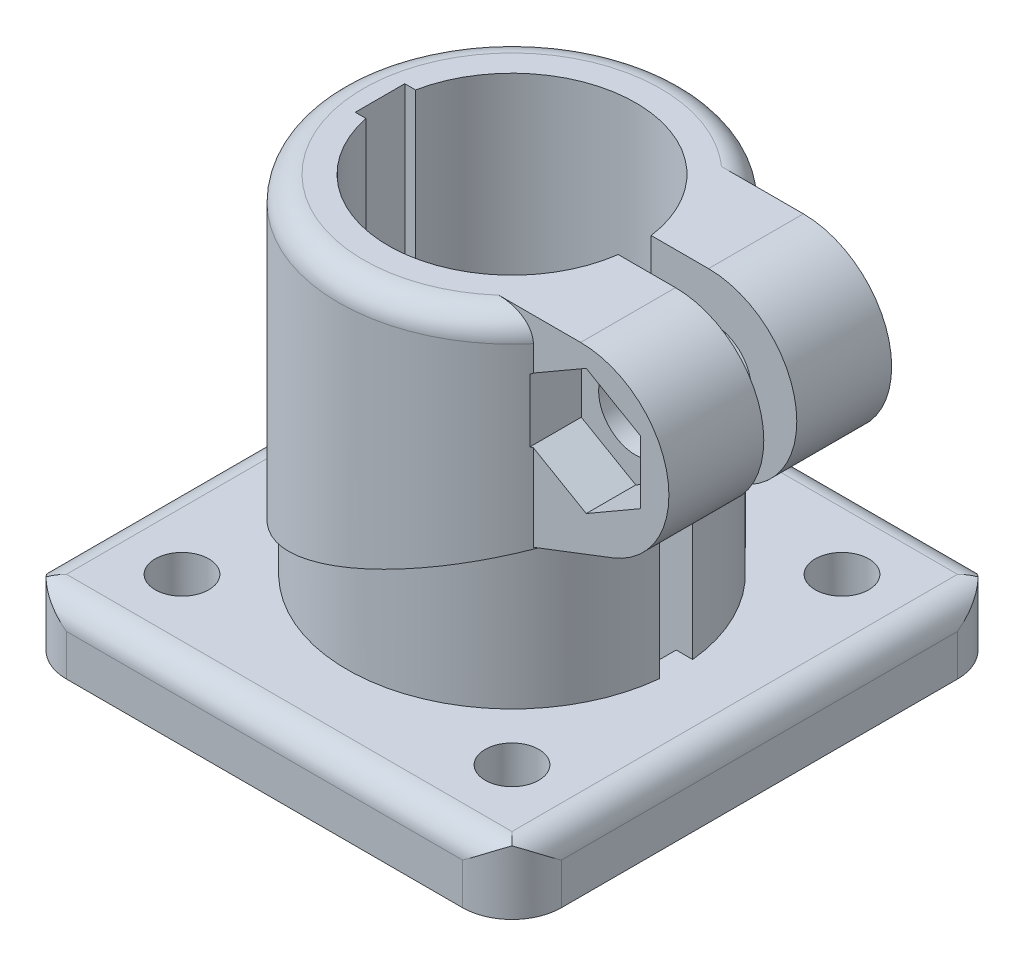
ISO-10303-21;
HEADER;
FILE_DESCRIPTION(('STEP AP214'),'2;1');
FILE_NAME('part.step','',(''),(''),'','','');
FILE_SCHEMA(('AUTOMOTIVE_DESIGN { 1 0 10303 214 1 1 1 1 }'));
ENDSEC;
DATA;
#1=APPLICATION_CONTEXT('core data for automotive mechanical design processes');
#2=APPLICATION_PROTOCOL_DEFINITION('international standard','automotive_design',2000,#1);
#3=PRODUCT_CONTEXT('',#1,'mechanical');
#4=PRODUCT('Part','Part','',(#3));
#5=PRODUCT_RELATED_PRODUCT_CATEGORY('part','',(#4));
#6=PRODUCT_DEFINITION_FORMATION('','',#4);
#7=PRODUCT_DEFINITION_CONTEXT('part definition',#1,'design');
#8=PRODUCT_DEFINITION('design','',#6,#7);
#9=PRODUCT_DEFINITION_SHAPE('','',#8);
#10=(LENGTH_UNIT() NAMED_UNIT(*) SI_UNIT(.MILLI.,.METRE.));
#11=(NAMED_UNIT(*) PLANE_ANGLE_UNIT() SI_UNIT($,.RADIAN.));
#12=(NAMED_UNIT(*) SI_UNIT($,.STERADIAN.) SOLID_ANGLE_UNIT());
#13=UNCERTAINTY_MEASURE_WITH_UNIT(LENGTH_MEASURE(1.E-05),#10,'distance_accuracy_value','');
#14=(GEOMETRIC_REPRESENTATION_CONTEXT(3) GLOBAL_UNCERTAINTY_ASSIGNED_CONTEXT((#13)) GLOBAL_UNIT_ASSIGNED_CONTEXT((#10,
#11,#12)) REPRESENTATION_CONTEXT('',''));
#15=CARTESIAN_POINT('',(0.,0.,0.));
#16=DIRECTION('',(0.,0.,1.));
#17=DIRECTION('',(1.,0.,0.));
#18=AXIS2_PLACEMENT_3D('',#15,#16,#17);
#19=CARTESIAN_POINT('',(0.,50.,0.));
#20=DIRECTION('',(0.,-1.,0.));
#21=DIRECTION('',(0.991071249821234,0.,0.133333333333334));
#22=AXIS2_PLACEMENT_3D('',#19,#20,#21);
#23=CYLINDRICAL_SURFACE('',#22,15.);
#24=CARTESIAN_POINT('',(0.,0.,0.));
#25=DIRECTION('',(0.,-1.,0.));
#26=DIRECTION('',(0.991071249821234,0.,0.133333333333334));
#27=AXIS2_PLACEMENT_3D('',#24,#25,#26);
#28=CIRCLE('',#27,15.);
#29=CARTESIAN_POINT('',(-14.6969384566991,-2.5E-06,3.));
#30=VERTEX_POINT('',#29);
#31=CARTESIAN_POINT('',(14.8660687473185,0.,2.));
#32=VERTEX_POINT('',#31);
#33=EDGE_CURVE('E1258',#30,#32,#28,.F.);
#34=ORIENTED_EDGE('',*,*,#33,.F.);
#35=DIRECTION('',(0.,1.,0.));
#36=VECTOR('',#35,1.);
#37=CARTESIAN_POINT('',(-14.6969384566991,-2.50000000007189E-05,3.));
#38=LINE('',#37,#36);
#39=CARTESIAN_POINT('',(-14.6969384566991,50.,3.));
#40=VERTEX_POINT('',#39);
#41=EDGE_CURVE('E1286',#30,#40,#38,.T.);
#42=ORIENTED_EDGE('',*,*,#41,.T.);
#43=CARTESIAN_POINT('',(0.,50.,0.));
#44=DIRECTION('',(0.,1.,0.));
#45=DIRECTION('',(-0.986013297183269,0.,0.166666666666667));
#46=AXIS2_PLACEMENT_3D('',#43,#44,#45);
#47=CIRCLE('',#46,15.);
#48=CARTESIAN_POINT('',(14.8660687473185,50.,2.));
#49=VERTEX_POINT('',#48);
#50=EDGE_CURVE('E1248',#40,#49,#47,.T.);
#51=ORIENTED_EDGE('',*,*,#50,.T.);
#52=DIRECTION('',(0.,-1.,0.));
#53=VECTOR('',#52,1.);
#54=CARTESIAN_POINT('',(14.8660687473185,50.,2.));
#55=LINE('',#54,#53);
#56=EDGE_CURVE('E1256',#49,#32,#55,.T.);
#57=ORIENTED_EDGE('',*,*,#56,.T.);
#58=EDGE_LOOP('',(#34,#42,#51,#57));
#59=FACE_BOUND('',#58,.T.);
#60=ADVANCED_FACE('F14',(#59),#23,.F.);
#61=CARTESIAN_POINT('',(0.,50.,0.));
#62=DIRECTION('',(0.,1.,0.));
#63=DIRECTION('',(0.991071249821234,0.,-0.133333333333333));
#64=AXIS2_PLACEMENT_3D('',#61,#62,#63);
#65=CIRCLE('',#64,15.);
#66=CARTESIAN_POINT('',(14.8660687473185,50.,-2.));
#67=VERTEX_POINT('',#66);
#68=CARTESIAN_POINT('',(-14.6969384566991,50.,-3.));
#69=VERTEX_POINT('',#68);
#70=EDGE_CURVE('E349',#67,#69,#65,.T.);
#71=ORIENTED_EDGE('',*,*,#70,.T.);
#72=DIRECTION('',(0.,1.,0.));
#73=VECTOR('',#72,1.);
#74=CARTESIAN_POINT('',(-14.6969384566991,-2.50000000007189E-05,-3.));
#75=LINE('',#74,#73);
#76=CARTESIAN_POINT('',(-14.6969384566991,-2.5E-06,-3.));
#77=VERTEX_POINT('',#76);
#78=EDGE_CURVE('E331',#77,#69,#75,.T.);
#79=ORIENTED_EDGE('',*,*,#78,.F.);
#80=CARTESIAN_POINT('',(0.,0.,0.));
#81=DIRECTION('',(0.,-1.,0.));
#82=DIRECTION('',(-0.986013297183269,0.,-0.166666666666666));
#83=AXIS2_PLACEMENT_3D('',#80,#81,#82);
#84=CIRCLE('',#83,15.);
#85=CARTESIAN_POINT('',(14.8660687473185,0.,-2.));
#86=VERTEX_POINT('',#85);
#87=EDGE_CURVE('E361',#86,#77,#84,.F.);
#88=ORIENTED_EDGE('',*,*,#87,.F.);
#89=DIRECTION('',(0.,1.,0.));
#90=VECTOR('',#89,1.);
#91=CARTESIAN_POINT('',(14.8660687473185,0.,-2.));
#92=LINE('',#91,#90);
#93=EDGE_CURVE('E356',#86,#67,#92,.T.);
#94=ORIENTED_EDGE('',*,*,#93,.T.);
#95=EDGE_LOOP('',(#71,#79,#88,#94));
#96=FACE_BOUND('',#95,.T.);
#97=ADVANCED_FACE('F355',(#96),#23,.F.);
#98=CARTESIAN_POINT('',(-30.,0.,-30.));
#99=DIRECTION('',(0.,-1.,0.));
#100=DIRECTION('',(1.,0.,0.));
#101=AXIS2_PLACEMENT_3D('',#98,#99,#100);
#102=PLANE('',#101);
#103=DIRECTION('',(-1.,0.,0.));
#104=VECTOR('',#103,1.);
#105=CARTESIAN_POINT('',(-30.,0.,3.));
#106=LINE('',#105,#104);
#107=CARTESIAN_POINT('',(-16.,0.,3.));
#108=VERTEX_POINT('',#107);
#109=EDGE_CURVE('E1257',#30,#108,#106,.T.);
#110=ORIENTED_EDGE('',*,*,#109,.F.);
#111=ORIENTED_EDGE('',*,*,#33,.T.);
#112=DIRECTION('',(1.,0.,0.));
#113=VECTOR('',#112,1.);
#114=CARTESIAN_POINT('',(14.8660687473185,0.,2.));
#115=LINE('',#114,#113);
#116=CARTESIAN_POINT('',(17.9,0.,2.));
#117=VERTEX_POINT('',#116);
#118=EDGE_CURVE('E401',#117,#32,#115,.F.);
#119=ORIENTED_EDGE('',*,*,#118,.F.);
#120=DIRECTION('',(0.,0.,-1.));
#121=VECTOR('',#120,1.);
#122=CARTESIAN_POINT('',(17.9,0.,2.));
#123=LINE('',#122,#121);
#124=CARTESIAN_POINT('',(17.9,0.,-2.));
#125=VERTEX_POINT('',#124);
#126=EDGE_CURVE('E406',#117,#125,#123,.T.);
#127=ORIENTED_EDGE('',*,*,#126,.T.);
#128=DIRECTION('',(-1.,0.,0.));
#129=VECTOR('',#128,1.);
#130=CARTESIAN_POINT('',(17.9,0.,-2.));
#131=LINE('',#130,#129);
#132=EDGE_CURVE('E411',#125,#86,#131,.T.);
#133=ORIENTED_EDGE('',*,*,#132,.T.);
#134=ORIENTED_EDGE('',*,*,#87,.T.);
#135=DIRECTION('',(1.,0.,0.));
#136=VECTOR('',#135,1.);
#137=CARTESIAN_POINT('',(-30.,0.,-3.));
#138=LINE('',#137,#136);
#139=CARTESIAN_POINT('',(-16.,0.,-3.));
#140=VERTEX_POINT('',#139);
#141=EDGE_CURVE('E337',#140,#77,#138,.T.);
#142=ORIENTED_EDGE('',*,*,#141,.F.);
#143=DIRECTION('',(0.,0.,1.));
#144=VECTOR('',#143,1.);
#145=CARTESIAN_POINT('',(-16.,0.,-2.5));
#146=LINE('',#145,#144);
#147=EDGE_CURVE('E416',#108,#140,#146,.F.);
#148=ORIENTED_EDGE('',*,*,#147,.F.);
#149=EDGE_LOOP('',(#110,#111,#119,#127,#133,#134,#142,#148));
#150=FACE_BOUND('',#149,.T.);
#151=CARTESIAN_POINT('',(-24.,0.,-24.));
#152=DIRECTION('',(0.,-1.,0.));
#153=DIRECTION('',(-1.,0.,0.));
#154=AXIS2_PLACEMENT_3D('',#151,#152,#153);
#155=CIRCLE('',#154,6.);
#156=CARTESIAN_POINT('',(-24.,0.,-30.));
#157=VERTEX_POINT('',#156);
#158=CARTESIAN_POINT('',(-30.,0.,-24.));
#159=VERTEX_POINT('',#158);
#160=EDGE_CURVE('E357',#157,#159,#155,.F.);
#161=ORIENTED_EDGE('',*,*,#160,.F.);
#162=DIRECTION('',(1.,0.,0.));
#163=VECTOR('',#162,1.);
#164=CARTESIAN_POINT('',(-24.,0.,-30.));
#165=LINE('',#164,#163);
#166=CARTESIAN_POINT('',(24.,0.,-30.));
#167=VERTEX_POINT('',#166);
#168=EDGE_CURVE('E359',#157,#167,#165,.T.);
#169=ORIENTED_EDGE('',*,*,#168,.T.);
#170=CARTESIAN_POINT('',(24.,0.,-24.));
#171=DIRECTION('',(0.,-1.,0.));
#172=DIRECTION('',(0.,0.,-1.));
#173=AXIS2_PLACEMENT_3D('',#170,#171,#172);
#174=CIRCLE('',#173,6.);
#175=CARTESIAN_POINT('',(30.,0.,-24.));
#176=VERTEX_POINT('',#175);
#177=EDGE_CURVE('E372',#167,#176,#174,.T.);
#178=ORIENTED_EDGE('',*,*,#177,.T.);
#179=DIRECTION('',(0.,0.,1.));
#180=VECTOR('',#179,1.);
#181=CARTESIAN_POINT('',(30.,0.,-24.));
#182=LINE('',#181,#180);
#183=CARTESIAN_POINT('',(30.,0.,24.));
#184=VERTEX_POINT('',#183);
#185=EDGE_CURVE('E377',#184,#176,#182,.F.);
#186=ORIENTED_EDGE('',*,*,#185,.F.);
#187=CARTESIAN_POINT('',(24.,0.,24.));
#188=DIRECTION('',(0.,-1.,0.));
#189=DIRECTION('',(1.,0.,0.));
#190=AXIS2_PLACEMENT_3D('',#187,#188,#189);
#191=CIRCLE('',#190,6.);
#192=CARTESIAN_POINT('',(24.,0.,30.));
#193=VERTEX_POINT('',#192);
#194=EDGE_CURVE('E382',#184,#193,#191,.T.);
#195=ORIENTED_EDGE('',*,*,#194,.T.);
#196=DIRECTION('',(-1.,0.,0.));
#197=VECTOR('',#196,1.);
#198=CARTESIAN_POINT('',(24.,0.,30.));
#199=LINE('',#198,#197);
#200=CARTESIAN_POINT('',(-24.,0.,30.));
#201=VERTEX_POINT('',#200);
#202=EDGE_CURVE('E387',#201,#193,#199,.F.);
#203=ORIENTED_EDGE('',*,*,#202,.F.);
#204=CARTESIAN_POINT('',(-24.,0.,24.));
#205=DIRECTION('',(0.,-1.,0.));
#206=DIRECTION('',(0.,0.,1.));
#207=AXIS2_PLACEMENT_3D('',#204,#205,#206);
#208=CIRCLE('',#207,6.);
#209=CARTESIAN_POINT('',(-30.,0.,24.));
#210=VERTEX_POINT('',#209);
#211=EDGE_CURVE('E392',#210,#201,#208,.F.);
#212=ORIENTED_EDGE('',*,*,#211,.F.);
#213=DIRECTION('',(0.,0.,-1.));
#214=VECTOR('',#213,1.);
#215=CARTESIAN_POINT('',(-30.,0.,24.));
#216=LINE('',#215,#214);
#217=EDGE_CURVE('E396',#210,#159,#216,.T.);
#218=ORIENTED_EDGE('',*,*,#217,.T.);
#219=EDGE_LOOP('',(#161,#169,#178,#186,#195,#203,#212,#218));
#220=FACE_BOUND('',#219,.T.);
#221=CARTESIAN_POINT('',(-20.,0.,20.));
#222=DIRECTION('',(0.,1.,0.));
#223=DIRECTION('',(0.,0.,-1.));
#224=AXIS2_PLACEMENT_3D('',#221,#222,#223);
#225=CIRCLE('',#224,3.25);
#226=CARTESIAN_POINT('',(-20.,0.,16.75));
#227=VERTEX_POINT('',#226);
#228=EDGE_CURVE('E420',#227,#227,#225,.F.);
#229=ORIENTED_EDGE('',*,*,#228,.F.);
#230=EDGE_LOOP('',(#229));
#231=FACE_BOUND('',#230,.T.);
#232=CARTESIAN_POINT('',(20.,0.,-20.));
#233=DIRECTION('',(0.,1.,0.));
#234=DIRECTION('',(0.,0.,-1.));
#235=AXIS2_PLACEMENT_3D('',#232,#233,#234);
#236=CIRCLE('',#235,3.25);
#237=CARTESIAN_POINT('',(20.,0.,-23.25));
#238=VERTEX_POINT('',#237);
#239=EDGE_CURVE('E425',#238,#238,#236,.F.);
#240=ORIENTED_EDGE('',*,*,#239,.F.);
#241=EDGE_LOOP('',(#240));
#242=FACE_BOUND('',#241,.T.);
#243=CARTESIAN_POINT('',(-20.,0.,-20.));
#244=DIRECTION('',(0.,1.,0.));
#245=DIRECTION('',(0.,0.,-1.));
#246=AXIS2_PLACEMENT_3D('',#243,#244,#245);
#247=CIRCLE('',#246,3.25);
#248=CARTESIAN_POINT('',(-20.,0.,-23.25));
#249=VERTEX_POINT('',#248);
#250=EDGE_CURVE('E428',#249,#249,#247,.F.);
#251=ORIENTED_EDGE('',*,*,#250,.F.);
#252=EDGE_LOOP('',(#251));
#253=FACE_BOUND('',#252,.T.);
#254=CARTESIAN_POINT('',(20.,0.,20.));
#255=DIRECTION('',(0.,1.,0.));
#256=DIRECTION('',(0.,0.,-1.));
#257=AXIS2_PLACEMENT_3D('',#254,#255,#256);
#258=CIRCLE('',#257,3.25);
#259=CARTESIAN_POINT('',(20.,0.,16.75));
#260=VERTEX_POINT('',#259);
#261=EDGE_CURVE('E431',#260,#260,#258,.F.);
#262=ORIENTED_EDGE('',*,*,#261,.F.);
#263=EDGE_LOOP('',(#262));
#264=FACE_BOUND('',#263,.T.);
#265=ADVANCED_FACE('F1275',(#150,#220,#231,#242,#253,#264),#102,.T.);
#266=CARTESIAN_POINT('',(32.5711855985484,0.,2.));
#267=DIRECTION('',(0.,0.,-1.));
#268=DIRECTION('',(-1.,0.,0.));
#269=AXIS2_PLACEMENT_3D('',#266,#267,#268);
#270=PLANE('',#269);
#271=DIRECTION('',(1.45278809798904E-12,-1.,0.));
#272=VECTOR('',#271,1.);
#273=CARTESIAN_POINT('',(19.899748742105,26.8715005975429,2.));
#274=LINE('',#273,#272);
#275=CARTESIAN_POINT('',(19.899748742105,26.8715005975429,2.));
#276=VERTEX_POINT('',#275);
#277=CARTESIAN_POINT('',(19.8997487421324,8.,2.));
#278=VERTEX_POINT('',#277);
#279=EDGE_CURVE('E434',#276,#278,#274,.T.);
#280=ORIENTED_EDGE('',*,*,#279,.T.);
#281=DIRECTION('',(-1.,0.,0.));
#282=VECTOR('',#281,1.);
#283=CARTESIAN_POINT('',(19.8997487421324,8.,2.));
#284=LINE('',#283,#282);
#285=CARTESIAN_POINT('',(17.9,8.,2.));
#286=VERTEX_POINT('',#285);
#287=EDGE_CURVE('E437',#278,#286,#284,.T.);
#288=ORIENTED_EDGE('',*,*,#287,.T.);
#289=DIRECTION('',(0.,-1.,0.));
#290=VECTOR('',#289,1.);
#291=CARTESIAN_POINT('',(17.9,8.,2.));
#292=LINE('',#291,#290);
#293=EDGE_CURVE('E442',#286,#117,#292,.T.);
#294=ORIENTED_EDGE('',*,*,#293,.T.);
#295=ORIENTED_EDGE('',*,*,#118,.T.);
#296=ORIENTED_EDGE('',*,*,#56,.F.);
#297=DIRECTION('',(1.,0.,0.));
#298=VECTOR('',#297,1.);
#299=CARTESIAN_POINT('',(14.8660687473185,50.,2.));
#300=LINE('',#299,#298);
#301=CARTESIAN_POINT('',(21.82,50.,2.));
#302=VERTEX_POINT('',#301);
#303=EDGE_CURVE('E447',#49,#302,#300,.T.);
#304=ORIENTED_EDGE('',*,*,#303,.T.);
#305=CARTESIAN_POINT('',(21.8199999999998,39.3,2.));
#306=DIRECTION('',(0.,0.,-1.));
#307=DIRECTION('',(0.,1.,0.));
#308=AXIS2_PLACEMENT_3D('',#305,#306,#307);
#309=CIRCLE('',#308,10.7);
#310=CARTESIAN_POINT('',(25.6592173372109,29.3124872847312,2.));
#311=VERTEX_POINT('',#310);
#312=EDGE_CURVE('E452',#302,#311,#309,.T.);
#313=ORIENTED_EDGE('',*,*,#312,.T.);
#314=DIRECTION('',(-0.933412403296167,-0.358805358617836,0.));
#315=VECTOR('',#314,1.);
#316=CARTESIAN_POINT('',(25.6592173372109,29.3124872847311,2.));
#317=LINE('',#316,#315);
#318=CARTESIAN_POINT('',(20.9045448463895,27.4847828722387,2.));
#319=VERTEX_POINT('',#318);
#320=EDGE_CURVE('E457',#311,#319,#317,.T.);
#321=ORIENTED_EDGE('',*,*,#320,.T.);
#322=DIRECTION('',(-1.59745602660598E-09,-1.,0.));
#323=VECTOR('',#322,1.);
#324=CARTESIAN_POINT('',(20.9045448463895,27.4847828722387,2.));
#325=LINE('',#324,#323);
#326=CARTESIAN_POINT('',(20.9045448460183,27.2523656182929,2.));
#327=VERTEX_POINT('',#326);
#328=EDGE_CURVE('E462',#319,#327,#325,.T.);
#329=ORIENTED_EDGE('',*,*,#328,.T.);
#330=DIRECTION('',(-0.9350791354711,-0.354439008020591,0.));
#331=VECTOR('',#330,1.);
#332=CARTESIAN_POINT('',(20.9045448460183,27.2523656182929,2.));
#333=LINE('',#332,#331);
#334=EDGE_CURVE('E467',#276,#327,#333,.F.);
#335=ORIENTED_EDGE('',*,*,#334,.F.);
#336=EDGE_LOOP('',(#280,#288,#294,#295,#296,#304,#313,#321,#329,#335));
#337=FACE_BOUND('',#336,.T.);
#338=CARTESIAN_POINT('',(22.5,40.,2.));
#339=DIRECTION('',(0.,0.,1.));
#340=DIRECTION('',(-1.,0.,0.));
#341=AXIS2_PLACEMENT_3D('',#338,#339,#340);
#342=CIRCLE('',#341,4.5);
#343=CARTESIAN_POINT('',(18.,40.,2.));
#344=VERTEX_POINT('',#343);
#345=EDGE_CURVE('E471',#344,#344,#342,.F.);
#346=ORIENTED_EDGE('',*,*,#345,.F.);
#347=EDGE_LOOP('',(#346));
#348=FACE_BOUND('',#347,.T.);
#349=DIRECTION('',(0.,-1.,0.));
#350=VECTOR('',#349,1.);
#351=CARTESIAN_POINT('',(15.5,27.,2.));
#352=LINE('',#351,#350);
#353=CARTESIAN_POINT('',(15.5,25.45,2.));
#354=VERTEX_POINT('',#353);
#355=CARTESIAN_POINT('',(15.5,27.,2.));
#356=VERTEX_POINT('',#355);
#357=EDGE_CURVE('E476',#354,#356,#352,.F.);
#358=ORIENTED_EDGE('',*,*,#357,.F.);
#359=DIRECTION('',(1.,0.,0.));
#360=VECTOR('',#359,1.);
#361=CARTESIAN_POINT('',(15.5,25.45,2.));
#362=LINE('',#361,#360);
#363=CARTESIAN_POINT('',(16.9,25.45,2.));
#364=VERTEX_POINT('',#363);
#365=EDGE_CURVE('E479',#354,#364,#362,.T.);
#366=ORIENTED_EDGE('',*,*,#365,.T.);
#367=DIRECTION('',(0.,1.,0.));
#368=VECTOR('',#367,1.);
#369=CARTESIAN_POINT('',(16.9,25.45,2.));
#370=LINE('',#369,#368);
#371=CARTESIAN_POINT('',(16.9,27.,2.));
#372=VERTEX_POINT('',#371);
#373=EDGE_CURVE('E484',#364,#372,#370,.T.);
#374=ORIENTED_EDGE('',*,*,#373,.T.);
#375=DIRECTION('',(-1.,0.,0.));
#376=VECTOR('',#375,1.);
#377=CARTESIAN_POINT('',(16.9,27.,2.));
#378=LINE('',#377,#376);
#379=EDGE_CURVE('E489',#356,#372,#378,.F.);
#380=ORIENTED_EDGE('',*,*,#379,.F.);
#381=EDGE_LOOP('',(#358,#366,#374,#380));
#382=FACE_BOUND('',#381,.T.);
#383=ADVANCED_FACE('F1282',(#337,#348,#382),#270,.T.);
#384=CARTESIAN_POINT('',(14.8660687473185,0.,-2.));
#385=DIRECTION('',(0.,0.,1.));
#386=DIRECTION('',(1.,0.,0.));
#387=AXIS2_PLACEMENT_3D('',#384,#385,#386);
#388=PLANE('',#387);
#389=DIRECTION('',(-6.77828306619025E-09,1.,0.));
#390=VECTOR('',#389,1.);
#391=CARTESIAN_POINT('',(19.8997487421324,8.,-2.));
#392=LINE('',#391,#390);
#393=CARTESIAN_POINT('',(19.8997487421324,8.,-2.));
#394=VERTEX_POINT('',#393);
#395=CARTESIAN_POINT('',(19.8997486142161,26.871500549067,-2.));
#396=VERTEX_POINT('',#395);
#397=EDGE_CURVE('E493',#394,#396,#392,.T.);
#398=ORIENTED_EDGE('',*,*,#397,.T.);
#399=DIRECTION('',(0.935079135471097,0.3544390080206,0.));
#400=VECTOR('',#399,1.);
#401=CARTESIAN_POINT('',(19.8997486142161,26.871500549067,-2.));
#402=LINE('',#401,#400);
#403=CARTESIAN_POINT('',(20.9045448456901,27.2523656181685,-2.));
#404=VERTEX_POINT('',#403);
#405=EDGE_CURVE('E498',#404,#396,#402,.F.);
#406=ORIENTED_EDGE('',*,*,#405,.F.);
#407=DIRECTION('',(4.93409033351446E-07,0.999999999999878,0.));
#408=VECTOR('',#407,1.);
#409=CARTESIAN_POINT('',(20.9045448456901,27.2523656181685,-2.));
#410=LINE('',#409,#408);
#411=CARTESIAN_POINT('',(20.9045449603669,27.4847829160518,-2.));
#412=VERTEX_POINT('',#411);
#413=EDGE_CURVE('E502',#404,#412,#410,.T.);
#414=ORIENTED_EDGE('',*,*,#413,.T.);
#415=DIRECTION('',(0.933412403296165,0.358805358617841,0.));
#416=VECTOR('',#415,1.);
#417=CARTESIAN_POINT('',(20.9045449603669,27.4847829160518,-2.));
#418=LINE('',#417,#416);
#419=CARTESIAN_POINT('',(25.6592173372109,29.3124872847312,-2.));
#420=VERTEX_POINT('',#419);
#421=EDGE_CURVE('E507',#412,#420,#418,.T.);
#422=ORIENTED_EDGE('',*,*,#421,.T.);
#423=CARTESIAN_POINT('',(21.8199999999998,39.3,-2.));
#424=DIRECTION('',(0.,0.,1.));
#425=DIRECTION('',(0.358805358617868,-0.933412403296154,0.));
#426=AXIS2_PLACEMENT_3D('',#423,#424,#425);
#427=CIRCLE('',#426,10.7);
#428=CARTESIAN_POINT('',(21.82,50.,-2.));
#429=VERTEX_POINT('',#428);
#430=EDGE_CURVE('E512',#420,#429,#427,.T.);
#431=ORIENTED_EDGE('',*,*,#430,.T.);
#432=DIRECTION('',(-1.,0.,0.));
#433=VECTOR('',#432,1.);
#434=CARTESIAN_POINT('',(21.82,50.,-2.));
#435=LINE('',#434,#433);
#436=EDGE_CURVE('E517',#429,#67,#435,.T.);
#437=ORIENTED_EDGE('',*,*,#436,.T.);
#438=ORIENTED_EDGE('',*,*,#93,.F.);
#439=ORIENTED_EDGE('',*,*,#132,.F.);
#440=DIRECTION('',(0.,1.,0.));
#441=VECTOR('',#440,1.);
#442=CARTESIAN_POINT('',(17.9,0.,-2.));
#443=LINE('',#442,#441);
#444=CARTESIAN_POINT('',(17.9,8.,-2.));
#445=VERTEX_POINT('',#444);
#446=EDGE_CURVE('E521',#125,#445,#443,.T.);
#447=ORIENTED_EDGE('',*,*,#446,.T.);
#448=DIRECTION('',(1.,0.,0.));
#449=VECTOR('',#448,1.);
#450=CARTESIAN_POINT('',(17.9,8.,-2.));
#451=LINE('',#450,#449);
#452=EDGE_CURVE('E526',#394,#445,#451,.F.);
#453=ORIENTED_EDGE('',*,*,#452,.F.);
#454=EDGE_LOOP('',(#398,#406,#414,#422,#431,#437,#438,#439,#447,#453));
#455=FACE_BOUND('',#454,.T.);
#456=CARTESIAN_POINT('',(22.5,40.,-2.));
#457=DIRECTION('',(0.,0.,-1.));
#458=DIRECTION('',(1.,0.,0.));
#459=AXIS2_PLACEMENT_3D('',#456,#457,#458);
#460=CIRCLE('',#459,4.5);
#461=CARTESIAN_POINT('',(27.,40.,-2.));
#462=VERTEX_POINT('',#461);
#463=EDGE_CURVE('E531',#462,#462,#460,.F.);
#464=ORIENTED_EDGE('',*,*,#463,.F.);
#465=EDGE_LOOP('',(#464));
#466=FACE_BOUND('',#465,.T.);
#467=DIRECTION('',(0.,-1.,0.));
#468=VECTOR('',#467,1.);
#469=CARTESIAN_POINT('',(16.9,27.,-2.));
#470=LINE('',#469,#468);
#471=CARTESIAN_POINT('',(16.9,25.45,-2.));
#472=VERTEX_POINT('',#471);
#473=CARTESIAN_POINT('',(16.9,27.,-2.));
#474=VERTEX_POINT('',#473);
#475=EDGE_CURVE('E536',#472,#474,#470,.F.);
#476=ORIENTED_EDGE('',*,*,#475,.F.);
#477=DIRECTION('',(-1.,0.,0.));
#478=VECTOR('',#477,1.);
#479=CARTESIAN_POINT('',(16.9,25.45,-2.));
#480=LINE('',#479,#478);
#481=CARTESIAN_POINT('',(15.5,25.45,-2.));
#482=VERTEX_POINT('',#481);
#483=EDGE_CURVE('E539',#472,#482,#480,.T.);
#484=ORIENTED_EDGE('',*,*,#483,.T.);
#485=DIRECTION('',(0.,1.,0.));
#486=VECTOR('',#485,1.);
#487=CARTESIAN_POINT('',(15.5,25.45,-2.));
#488=LINE('',#487,#486);
#489=CARTESIAN_POINT('',(15.5,27.,-2.));
#490=VERTEX_POINT('',#489);
#491=EDGE_CURVE('E544',#482,#490,#488,.T.);
#492=ORIENTED_EDGE('',*,*,#491,.T.);
#493=DIRECTION('',(1.,0.,0.));
#494=VECTOR('',#493,1.);
#495=CARTESIAN_POINT('',(15.5,27.,-2.));
#496=LINE('',#495,#494);
#497=EDGE_CURVE('E549',#474,#490,#496,.F.);
#498=ORIENTED_EDGE('',*,*,#497,.F.);
#499=EDGE_LOOP('',(#476,#484,#492,#498));
#500=FACE_BOUND('',#499,.T.);
#501=ADVANCED_FACE('F584',(#455,#466,#500),#388,.T.);
#502=CARTESIAN_POINT('',(0.,10.81,0.));
#503=DIRECTION('',(0.,-1.,0.));
#504=DIRECTION('',(-1.,0.,2.32013602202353E-09));
#505=AXIS2_PLACEMENT_3D('',#502,#503,#504);
#506=CYLINDRICAL_SURFACE('',#505,21.);
#507=DIRECTION('',(-1.2923286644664E-11,-1.,-1.53979830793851E-11));
#508=VECTOR('',#507,1.);
#509=CARTESIAN_POINT('',(16.085707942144,46.9999977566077,-13.5000000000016));
#510=LINE('',#509,#508);
#511=CARTESIAN_POINT('',(16.0857079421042,43.9177303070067,-13.5000000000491));
#512=VERTEX_POINT('',#511);
#513=CARTESIAN_POINT('',(16.085707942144,47.0000000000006,-13.5000000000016));
#514=VERTEX_POINT('',#513);
#515=EDGE_CURVE('E553',#512,#514,#510,.F.);
#516=ORIENTED_EDGE('',*,*,#515,.F.);
#517=CARTESIAN_POINT('',(15.8999999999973,43.8105117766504,-13.7182360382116));
#518=CARTESIAN_POINT('',(15.9623982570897,43.8465374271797,-13.6459138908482));
#519=CARTESIAN_POINT('',(16.024302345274,43.8822777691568,-13.573166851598));
#520=CARTESIAN_POINT('',(16.0857079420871,43.9177303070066,-13.5000000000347));
#521=B_SPLINE_CURVE_WITH_KNOTS('',3,(#517,#518,#519,#520),.UNSPECIFIED.,.F.,.F.,(4,4),(0.,1.),.UNSPECIFIED.);
#522=CARTESIAN_POINT('',(15.8999999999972,43.8105117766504,-13.7182360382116));
#523=VERTEX_POINT('',#522);
#524=EDGE_CURVE('E558',#523,#512,#521,.T.);
#525=ORIENTED_EDGE('',*,*,#524,.F.);
#526=DIRECTION('',(2.78305145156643E-13,-1.,3.22591558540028E-13));
#527=VECTOR('',#526,1.);
#528=CARTESIAN_POINT('',(15.8999999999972,43.8105117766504,-13.7182360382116));
#529=LINE('',#528,#527);
#530=CARTESIAN_POINT('',(15.8999999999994,36.1894882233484,-13.7182360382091));
#531=VERTEX_POINT('',#530);
#532=EDGE_CURVE('E571',#531,#523,#529,.F.);
#533=ORIENTED_EDGE('',*,*,#532,.F.);
#534=CARTESIAN_POINT('',(16.085707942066,36.0822696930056,-13.5000000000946));
#535=CARTESIAN_POINT('',(16.024302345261,36.1177222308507,-13.5731668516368));
#536=CARTESIAN_POINT('',(15.9623982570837,36.1534625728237,-13.6459138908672));
#537=CARTESIAN_POINT('',(15.8999999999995,36.1894882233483,-13.7182360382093));
#538=B_SPLINE_CURVE_WITH_KNOTS('',3,(#534,#535,#536,#537),.UNSPECIFIED.,.F.,.F.,(4,4),(0.,1.),.UNSPECIFIED.);
#539=CARTESIAN_POINT('',(16.085707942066,36.0822696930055,-13.5000000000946));
#540=VERTEX_POINT('',#539);
#541=EDGE_CURVE('E1151',#540,#531,#538,.T.);
#542=ORIENTED_EDGE('',*,*,#541,.F.);
#543=DIRECTION('',(-5.31600442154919E-09,-1.,-6.33419931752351E-09));
#544=VECTOR('',#543,1.);
#545=CARTESIAN_POINT('',(16.085707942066,36.0822696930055,-13.5000000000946));
#546=LINE('',#545,#544);
#547=CARTESIAN_POINT('',(16.0857078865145,25.6324135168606,-13.5000000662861));
#548=VERTEX_POINT('',#547);
#549=EDGE_CURVE('E1898',#548,#540,#546,.F.);
#550=ORIENTED_EDGE('',*,*,#549,.F.);
#551=CARTESIAN_POINT('',(20.9045449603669,27.4847829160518,-1.99999999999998));
#552=CARTESIAN_POINT('',(20.499581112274,27.3291141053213,-6.23279322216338));
#553=CARTESIAN_POINT('',(18.8192143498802,26.6831781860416,-10.2429345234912));
#554=CARTESIAN_POINT('',(16.0857078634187,25.6324135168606,-13.5000000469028));
#555=B_SPLINE_CURVE_WITH_KNOTS('',3,(#551,#552,#553,#554),.UNSPECIFIED.,.F.,.F.,(4,4),(0.,1.),.UNSPECIFIED.);
#556=EDGE_CURVE('E639',#412,#548,#555,.T.);
#557=ORIENTED_EDGE('',*,*,#556,.F.);
#558=ORIENTED_EDGE('',*,*,#413,.F.);
#559=CARTESIAN_POINT('',(-21.0000278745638,11.3685600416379,4.8722859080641E-08));
#560=CARTESIAN_POINT('',(-21.0006006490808,11.3683429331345,-2.95393414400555));
#561=CARTESIAN_POINT('',(-20.3781173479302,11.6042934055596,-5.93067552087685));
#562=CARTESIAN_POINT('',(-17.3908638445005,12.7366030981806,-12.4693908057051));
#563=CARTESIAN_POINT('',(-14.6693040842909,13.7682023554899,-15.5370290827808));
#564=CARTESIAN_POINT('',(-8.02713696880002,16.2858963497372,-19.8023332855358));
#565=CARTESIAN_POINT('',(-4.10653041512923,17.7719907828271,-20.9999992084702));
#566=CARTESIAN_POINT('',(4.12499617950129,20.8921268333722,-20.9999989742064));
#567=CARTESIAN_POINT('',(8.06137022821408,22.3841978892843,-19.7920741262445));
#568=CARTESIAN_POINT('',(14.7212333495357,24.9085995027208,-15.492240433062));
#569=CARTESIAN_POINT('',(17.4447216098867,25.9409297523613,-12.40033158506));
#570=CARTESIAN_POINT('',(20.0903720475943,26.9437558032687,-6.53307502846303));
#571=CARTESIAN_POINT('',(20.6852387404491,27.1692382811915,-4.29237917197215));
#572=CARTESIAN_POINT('',(20.9045448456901,27.2523656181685,-2.00000059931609));
#573=B_SPLINE_CURVE_WITH_KNOTS('',3,(#559,#560,#561,#562,#563,#564,#565,#566,#567,#568,#569,
#570,#571,#572),.UNSPECIFIED.,.F.,.F.,(4,2,2,2,2,2,4),(0.,0.140752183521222,0.328836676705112,
0.516921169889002,0.70583483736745,0.894748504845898,1.),.UNSPECIFIED.);
#574=CARTESIAN_POINT('',(-21.,11.3684865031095,4.87228564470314E-08));
#575=VERTEX_POINT('',#574);
#576=EDGE_CURVE('E632',#575,#404,#573,.T.);
#577=ORIENTED_EDGE('',*,*,#576,.F.);
#578=CARTESIAN_POINT('',(20.9045448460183,27.2523656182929,2.00000059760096));
#579=CARTESIAN_POINT('',(20.5402725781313,27.1142892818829,5.80769077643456));
#580=CARTESIAN_POINT('',(19.1557189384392,26.5894782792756,9.36357233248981));
#581=CARTESIAN_POINT('',(14.8173319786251,24.9450254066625,15.3316062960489));
#582=CARTESIAN_POINT('',(11.8634993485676,23.8253837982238,17.7437587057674));
#583=CARTESIAN_POINT('',(4.28785488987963,20.9538579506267,21.0315960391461));
#584=CARTESIAN_POINT('',(-0.120738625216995,19.2827934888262,21.4228279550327));
#585=CARTESIAN_POINT('',(-8.41772160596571,16.1378463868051,19.7000065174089));
#586=CARTESIAN_POINT('',(-12.3061101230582,14.6639641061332,17.5859531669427));
#587=CARTESIAN_POINT('',(-19.0509525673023,12.1073513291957,10.3727692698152));
#588=CARTESIAN_POINT('',(-20.9990733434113,11.368921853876,5.22202301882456));
#589=CARTESIAN_POINT('',(-21.0000278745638,11.3685600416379,4.8722859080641E-08));
#590=B_SPLINE_CURVE_WITH_KNOTS('',3,(#578,#579,#580,#581,#582,#583,#584,#585,#586,#587,#588,
#589),.UNSPECIFIED.,.F.,.F.,(4,2,2,2,2,4),(0.,0.173946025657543,0.347892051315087,
0.550142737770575,0.752393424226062,1.),.UNSPECIFIED.);
#591=EDGE_CURVE('E635',#327,#575,#590,.T.);
#592=ORIENTED_EDGE('',*,*,#591,.F.);
#593=ORIENTED_EDGE('',*,*,#328,.F.);
#594=CARTESIAN_POINT('',(16.0857077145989,25.632413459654,13.5000002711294));
#595=CARTESIAN_POINT('',(18.8192140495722,26.6831780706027,10.2429348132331));
#596=CARTESIAN_POINT('',(20.4995808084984,27.3291139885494,6.23279367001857));
#597=CARTESIAN_POINT('',(20.9045448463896,27.4847828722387,2.0000005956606));
#598=B_SPLINE_CURVE_WITH_KNOTS('',3,(#594,#595,#596,#597),.UNSPECIFIED.,.F.,.F.,(4,4),(0.,1.),.UNSPECIFIED.);
#599=CARTESIAN_POINT('',(16.0857077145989,25.632413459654,13.5000002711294));
#600=VERTEX_POINT('',#599);
#601=EDGE_CURVE('E644',#600,#319,#598,.T.);
#602=ORIENTED_EDGE('',*,*,#601,.F.);
#603=DIRECTION('',(2.17750476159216E-08,1.,-2.59457078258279E-08));
#604=VECTOR('',#603,1.);
#605=CARTESIAN_POINT('',(16.0857077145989,25.632413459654,13.5000002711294));
#606=LINE('',#605,#604);
#607=CARTESIAN_POINT('',(16.085707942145,36.0822696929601,13.5000000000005));
#608=VERTEX_POINT('',#607);
#609=EDGE_CURVE('E1300',#600,#608,#606,.T.);
#610=ORIENTED_EDGE('',*,*,#609,.T.);
#611=CARTESIAN_POINT('',(15.8999999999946,36.1894882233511,13.7182360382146));
#612=CARTESIAN_POINT('',(15.9623982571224,36.1534625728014,13.6459138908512));
#613=CARTESIAN_POINT('',(16.024302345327,36.1177222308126,13.5731668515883));
#614=CARTESIAN_POINT('',(16.0857079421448,36.0822696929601,13.5000000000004));
#615=B_SPLINE_CURVE_WITH_KNOTS('',3,(#611,#612,#613,#614),.UNSPECIFIED.,.F.,.F.,(4,4),(0.,1.),.UNSPECIFIED.);
#616=CARTESIAN_POINT('',(15.8999999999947,36.1894882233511,13.7182360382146));
#617=VERTEX_POINT('',#616);
#618=EDGE_CURVE('E1061',#617,#608,#615,.T.);
#619=ORIENTED_EDGE('',*,*,#618,.F.);
#620=DIRECTION('',(6.23272996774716E-13,1.,-7.22334710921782E-13));
#621=VECTOR('',#620,1.);
#622=CARTESIAN_POINT('',(15.8999999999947,36.1894882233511,13.7182360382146));
#623=LINE('',#622,#621);
#624=CARTESIAN_POINT('',(15.8999999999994,43.8105117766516,13.7182360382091));
#625=VERTEX_POINT('',#624);
#626=EDGE_CURVE('E1396',#625,#617,#623,.F.);
#627=ORIENTED_EDGE('',*,*,#626,.F.);
#628=CARTESIAN_POINT('',(16.0857079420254,43.917730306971,13.5000000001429));
#629=CARTESIAN_POINT('',(16.0243023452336,43.8822777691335,13.5731668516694));
#630=CARTESIAN_POINT('',(15.9623982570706,43.8465374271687,13.6459138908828));
#631=CARTESIAN_POINT('',(15.8999999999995,43.8105117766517,13.7182360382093));
#632=B_SPLINE_CURVE_WITH_KNOTS('',3,(#628,#629,#630,#631),.UNSPECIFIED.,.F.,.F.,(4,4),(0.,1.),.UNSPECIFIED.);
#633=CARTESIAN_POINT('',(16.0857079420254,43.917730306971,13.5000000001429));
#634=VERTEX_POINT('',#633);
#635=EDGE_CURVE('E1391',#634,#625,#632,.T.);
#636=ORIENTED_EDGE('',*,*,#635,.F.);
#637=DIRECTION('',(3.91525045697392E-11,1.,-4.66520856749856E-11));
#638=VECTOR('',#637,1.);
#639=CARTESIAN_POINT('',(16.0857079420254,43.917730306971,13.5000000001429));
#640=LINE('',#639,#638);
#641=CARTESIAN_POINT('',(16.0857079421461,47.,13.4999999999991));
#642=VERTEX_POINT('',#641);
#643=EDGE_CURVE('E1388',#634,#642,#640,.T.);
#644=ORIENTED_EDGE('',*,*,#643,.T.);
#645=CARTESIAN_POINT('',(0.,47.,0.));
#646=DIRECTION('',(0.,-1.,0.));
#647=DIRECTION('',(0.765986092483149,0.,0.642857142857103));
#648=AXIS2_PLACEMENT_3D('',#645,#646,#647);
#649=CIRCLE('',#648,21.);
#650=EDGE_CURVE('E1906',#642,#514,#649,.T.);
#651=ORIENTED_EDGE('',*,*,#650,.T.);
#652=EDGE_LOOP('',(#516,#525,#533,#542,#550,#557,#558,#577,#592,#593,#602,#610,#619,#627,#636,
#644,#651));
#653=FACE_BOUND('',#652,.T.);
#654=ADVANCED_FACE('F573',(#653),#506,.T.);
#655=CARTESIAN_POINT('',(11.9058809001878,25.6324135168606,-13.5));
#656=DIRECTION('',(0.,0.,-1.));
#657=DIRECTION('',(0.,1.,0.));
#658=AXIS2_PLACEMENT_3D('',#655,#656,#657);
#659=PLANE('',#658);
#660=DIRECTION('',(0.866025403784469,-0.499999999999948,0.));
#661=VECTOR('',#660,1.);
#662=CARTESIAN_POINT('',(16.085707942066,36.0822696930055,-13.5));
#663=LINE('',#662,#661);
#664=CARTESIAN_POINT('',(22.5,32.378976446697,-13.5));
#665=VERTEX_POINT('',#664);
#666=EDGE_CURVE('E1907',#665,#540,#663,.F.);
#667=ORIENTED_EDGE('',*,*,#666,.F.);
#668=DIRECTION('',(0.866025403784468,0.499999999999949,0.));
#669=VECTOR('',#668,1.);
#670=CARTESIAN_POINT('',(22.5,32.378976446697,-13.5));
#671=LINE('',#670,#669);
#672=CARTESIAN_POINT('',(29.1,36.189488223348,-13.5));
#673=VERTEX_POINT('',#672);
#674=EDGE_CURVE('E1909',#673,#665,#671,.F.);
#675=ORIENTED_EDGE('',*,*,#674,.F.);
#676=DIRECTION('',(0.,1.,0.));
#677=VECTOR('',#676,1.);
#678=CARTESIAN_POINT('',(29.1,36.189488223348,-13.5));
#679=LINE('',#678,#677);
#680=CARTESIAN_POINT('',(29.1,43.810511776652,-13.5));
#681=VERTEX_POINT('',#680);
#682=EDGE_CURVE('E1919',#681,#673,#679,.F.);
#683=ORIENTED_EDGE('',*,*,#682,.F.);
#684=DIRECTION('',(-0.866025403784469,0.499999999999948,0.));
#685=VECTOR('',#684,1.);
#686=CARTESIAN_POINT('',(29.1,43.810511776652,-13.5));
#687=LINE('',#686,#685);
#688=CARTESIAN_POINT('',(22.5,47.621023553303,-13.5));
#689=VERTEX_POINT('',#688);
#690=EDGE_CURVE('E1904',#689,#681,#687,.F.);
#691=ORIENTED_EDGE('',*,*,#690,.F.);
#692=DIRECTION('',(-0.866025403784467,-0.499999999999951,0.));
#693=VECTOR('',#692,1.);
#694=CARTESIAN_POINT('',(22.5,47.621023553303,-13.5));
#695=LINE('',#694,#693);
#696=EDGE_CURVE('E1900',#512,#689,#695,.F.);
#697=ORIENTED_EDGE('',*,*,#696,.F.);
#698=ORIENTED_EDGE('',*,*,#515,.T.);
#699=CARTESIAN_POINT('',(11.9058809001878,50.,-13.4999999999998));
#700=CARTESIAN_POINT('',(12.0269034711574,49.9999947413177,-13.5000003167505));
#701=CARTESIAN_POINT('',(12.1479648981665,49.9967953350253,-13.500005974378));
#702=CARTESIAN_POINT('',(12.3904821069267,49.9835908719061,-13.500021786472));
#703=CARTESIAN_POINT('',(12.5119355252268,49.9735428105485,-13.5000319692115));
#704=CARTESIAN_POINT('',(12.6936806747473,49.9530245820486,-13.5000458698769));
#705=CARTESIAN_POINT('',(12.7542846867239,49.9452609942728,-13.5000502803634));
#706=CARTESIAN_POINT('',(12.8752937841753,49.9278496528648,-13.5000581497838));
#707=CARTESIAN_POINT('',(12.9356985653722,49.9181997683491,-13.5000616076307));
#708=CARTESIAN_POINT('',(13.0561965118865,49.896961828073,-13.5000671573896));
#709=CARTESIAN_POINT('',(13.1162895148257,49.8853728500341,-13.5000692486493));
#710=CARTESIAN_POINT('',(13.2360477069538,49.8602050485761,-13.5000718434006));
#711=CARTESIAN_POINT('',(13.2957129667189,49.8466265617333,-13.5000723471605));
#712=CARTESIAN_POINT('',(13.4144931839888,49.8174316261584,-13.5000717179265));
#713=CARTESIAN_POINT('',(13.4736085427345,49.8018168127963,-13.5000705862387));
#714=CARTESIAN_POINT('',(13.5911608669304,49.7685049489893,-13.5000668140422));
#715=CARTESIAN_POINT('',(13.6495986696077,49.7508108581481,-13.5000641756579));
#716=CARTESIAN_POINT('',(13.7656619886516,49.7133005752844,-13.5000576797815));
#717=CARTESIAN_POINT('',(13.8232888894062,49.693488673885,-13.5000538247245));
#718=CARTESIAN_POINT('',(13.937590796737,49.6517078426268,-13.50004532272));
#719=CARTESIAN_POINT('',(13.9942678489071,49.6297445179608,-13.5000406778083));
#720=CARTESIAN_POINT('',(14.106524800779,49.5836314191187,-13.5000311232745));
#721=CARTESIAN_POINT('',(14.1621075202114,49.5594885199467,-13.5000262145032));
#722=CARTESIAN_POINT('',(14.2720250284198,49.508992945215,-13.5000167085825));
#723=CARTESIAN_POINT('',(14.3263635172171,49.4826483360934,-13.5000121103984));
#724=CARTESIAN_POINT('',(14.4336364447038,49.42773272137,-13.5000037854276));
#725=CARTESIAN_POINT('',(14.4865755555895,49.3991708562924,-13.500000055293));
#726=CARTESIAN_POINT('',(14.5908885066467,49.3398114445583,-13.4999939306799));
#727=CARTESIAN_POINT('',(14.6422680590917,49.3090239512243,-13.4999915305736));
#728=CARTESIAN_POINT('',(14.7432958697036,49.2452119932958,-13.4999883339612));
#729=CARTESIAN_POINT('',(14.7929509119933,49.212198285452,-13.4999875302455));
#730=CARTESIAN_POINT('',(14.8903592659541,49.1439412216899,-13.4999875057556));
#731=CARTESIAN_POINT('',(14.9381204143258,49.1087090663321,-13.4999882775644));
#732=CARTESIAN_POINT('',(15.0315665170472,49.036031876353,-13.4999908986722));
#733=CARTESIAN_POINT('',(15.0772602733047,48.9985981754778,-13.4999927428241));
#734=CARTESIAN_POINT('',(15.1663938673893,48.921544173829,-13.4999966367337));
#735=CARTESIAN_POINT('',(15.2098432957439,48.8819349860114,-13.4999986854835));
#736=CARTESIAN_POINT('',(15.2943027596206,48.8005727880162,-13.500000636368));
#737=CARTESIAN_POINT('',(15.335323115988,48.7588305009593,-13.5000005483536));
#738=CARTESIAN_POINT('',(15.4147170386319,48.6732720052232,-13.500001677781));
#739=CARTESIAN_POINT('',(15.4531026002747,48.6294669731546,-13.5000028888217));
#740=CARTESIAN_POINT('',(15.5086101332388,48.5621936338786,-13.5000044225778));
#741=CARTESIAN_POINT('',(15.5267377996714,48.539548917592,-13.5000048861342));
#742=CARTESIAN_POINT('',(15.562261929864,48.4937729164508,-13.5000056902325));
#743=CARTESIAN_POINT('',(15.5796599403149,48.4706428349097,-13.5000060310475));
#744=CARTESIAN_POINT('',(15.6137008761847,48.4239082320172,-13.5000065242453));
#745=CARTESIAN_POINT('',(15.6303453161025,48.4003048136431,-13.5000066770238));
#746=CARTESIAN_POINT('',(15.6628563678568,48.3526354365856,-13.5000067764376));
#747=CARTESIAN_POINT('',(15.6787244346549,48.3285704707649,-13.5000067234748));
#748=CARTESIAN_POINT('',(15.709659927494,48.2799910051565,-13.500006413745));
#749=CARTESIAN_POINT('',(15.7247287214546,48.2554773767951,-13.5000061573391));
#750=CARTESIAN_POINT('',(15.7540431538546,48.2060143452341,-13.5000054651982));
#751=CARTESIAN_POINT('',(15.7682900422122,48.1810656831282,-13.5000050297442));
#752=CARTESIAN_POINT('',(15.7959383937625,48.1307471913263,-13.5000040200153));
#753=CARTESIAN_POINT('',(15.8093409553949,48.1053779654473,-13.5000034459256));
#754=CARTESIAN_POINT('',(15.835278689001,48.054233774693,-13.5000022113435));
#755=CARTESIAN_POINT('',(15.8478147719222,48.0284592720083,-13.5000015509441));
#756=CARTESIAN_POINT('',(15.871997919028,47.976520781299,-13.5000002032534));
#757=CARTESIAN_POINT('',(15.8836456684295,47.9503571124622,-13.4999995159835));
#758=CARTESIAN_POINT('',(15.9060308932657,47.8976573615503,-13.4999981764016));
#759=CARTESIAN_POINT('',(15.9167687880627,47.8711214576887,-13.4999975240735));
#760=CARTESIAN_POINT('',(15.9373134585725,47.8176951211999,-13.4999963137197));
#761=CARTESIAN_POINT('',(15.9471203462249,47.7908047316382,-13.4999957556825));
#762=CARTESIAN_POINT('',(15.9657826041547,47.7366881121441,-13.4999947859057));
#763=CARTESIAN_POINT('',(15.9746377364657,47.7094618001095,-13.4999943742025));
#764=CARTESIAN_POINT('',(15.9913765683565,47.6546928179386,-13.4999937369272));
#765=CARTESIAN_POINT('',(15.9992596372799,47.6271499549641,-13.4999935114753));
#766=CARTESIAN_POINT('',(16.01403494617,47.5717681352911,-13.4999932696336));
#767=CARTESIAN_POINT('',(16.0209261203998,47.5439288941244,-13.499993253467));
#768=CARTESIAN_POINT('',(16.0336987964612,47.4879753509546,-13.4999934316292));
#769=CARTESIAN_POINT('',(16.0395787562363,47.4598606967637,-13.4999936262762));
#770=CARTESIAN_POINT('',(16.0503107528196,47.4033781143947,-13.4999942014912));
#771=CARTESIAN_POINT('',(16.0551607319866,47.375009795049,-13.4999945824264));
#772=CARTESIAN_POINT('',(16.063815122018,47.3180424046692,-13.4999954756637));
#773=CARTESIAN_POINT('',(16.0676169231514,47.2894429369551,-13.4999959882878));
#774=CARTESIAN_POINT('',(16.0741580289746,47.232036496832,-13.4999970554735));
#775=CARTESIAN_POINT('',(16.0768941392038,47.2032291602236,-13.4999976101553));
#776=CARTESIAN_POINT('',(16.0812873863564,47.1454309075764,-13.4999986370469));
#777=CARTESIAN_POINT('',(16.0829407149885,47.1164397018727,-13.4999991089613));
#778=CARTESIAN_POINT('',(16.0851535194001,47.0582983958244,-13.4999997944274));
#779=CARTESIAN_POINT('',(16.0857085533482,47.0291481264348,-13.5000000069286));
#780=CARTESIAN_POINT('',(16.0857079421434,46.9999977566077,-13.500000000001));
#781=B_SPLINE_CURVE_WITH_KNOTS('',3,(#699,#700,#701,#702,#703,#704,#705,#706,#707,#708,#709,
#710,#711,#712,#713,#714,#715,#716,#717,#718,#719,#720,#721,#722,#723,#724,#725,#726,#727,#728,
#729,#730,#731,#732,#733,#734,#735,#736,#737,#738,#739,#740,#741,#742,#743,#744,#745,#746,#747,
#748,#749,#750,#751,#752,#753,#754,#755,#756,#757,#758,#759,#760,#761,#762,#763,#764,#765,#766,
#767,#768,#769,#770,#771,#772,#773,#774,#775,#776,#777,#778,#779,#780),.UNSPECIFIED.,.F.,.F.,(4,
2,2,2,2,2,2,2,2,2,2,2,2,2,2,2,2,2,2,2,2,2,2,2,2,2,2,2,2,2,2,2,2,2,2,2,2,2,2,2,4),(0.,
0.363091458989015,0.728484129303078,0.91175677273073,1.09523766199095,1.27880606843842,
1.46234345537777,1.64573434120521,1.8288672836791,2.01163599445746,2.1939405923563,
2.37568900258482,2.55679850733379,2.73719745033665,2.91682709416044,3.09564362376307,
3.27362028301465,3.45074962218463,3.62704582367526,3.80252941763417,3.97715228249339,
4.06416188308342,4.15097661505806,4.23760833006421,4.32407093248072,4.41038043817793,
4.49655502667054,4.58261508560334,4.66858324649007,4.75448441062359,4.84034576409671,
4.9261967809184,5.01206921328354,5.09799706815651,5.18401656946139,5.27016610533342,
5.3564861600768,5.44301923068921,5.5298097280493,5.61690386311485,5.70434951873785),.UNSPECIFIED.);
#782=CARTESIAN_POINT('',(11.9058809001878,50.,-13.5));
#783=VERTEX_POINT('',#782);
#784=EDGE_CURVE('E1223',#783,#514,#781,.T.);
#785=ORIENTED_EDGE('',*,*,#784,.F.);
#786=DIRECTION('',(1.,0.,0.));
#787=VECTOR('',#786,1.);
#788=CARTESIAN_POINT('',(11.9058809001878,50.,-13.5));
#789=LINE('',#788,#787);
#790=CARTESIAN_POINT('',(21.82,50.,-13.5));
#791=VERTEX_POINT('',#790);
#792=EDGE_CURVE('E1936',#791,#783,#789,.F.);
#793=ORIENTED_EDGE('',*,*,#792,.F.);
#794=CARTESIAN_POINT('',(21.8199999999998,39.3,-13.5));
#795=DIRECTION('',(0.,0.,-1.));
#796=DIRECTION('',(0.,1.,0.));
#797=AXIS2_PLACEMENT_3D('',#794,#795,#796);
#798=CIRCLE('',#797,10.7);
#799=CARTESIAN_POINT('',(25.6592173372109,29.3124872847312,-13.5));
#800=VERTEX_POINT('',#799);
#801=EDGE_CURVE('E1943',#800,#791,#798,.F.);
#802=ORIENTED_EDGE('',*,*,#801,.F.);
#803=DIRECTION('',(-0.93341240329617,-0.358805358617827,0.));
#804=VECTOR('',#803,1.);
#805=CARTESIAN_POINT('',(25.6592173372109,29.3124872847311,-13.5));
#806=LINE('',#805,#804);
#807=EDGE_CURVE('E1947',#548,#800,#806,.F.);
#808=ORIENTED_EDGE('',*,*,#807,.F.);
#809=ORIENTED_EDGE('',*,*,#549,.T.);
#810=EDGE_LOOP('',(#667,#675,#683,#691,#697,#698,#785,#793,#802,#808,#809));
#811=FACE_BOUND('',#810,.T.);
#812=ADVANCED_FACE('F583',(#811),#659,.T.);
#813=CARTESIAN_POINT('',(11.9058809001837,25.632413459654,13.5));
#814=DIRECTION('',(0.,0.,1.));
#815=DIRECTION('',(1.,0.,0.));
#816=AXIS2_PLACEMENT_3D('',#813,#814,#815);
#817=PLANE('',#816);
#818=DIRECTION('',(-0.866025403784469,-0.499999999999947,0.));
#819=VECTOR('',#818,1.);
#820=CARTESIAN_POINT('',(29.1,36.189488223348,13.5));
#821=LINE('',#820,#819);
#822=CARTESIAN_POINT('',(29.1,36.189488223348,13.5));
#823=VERTEX_POINT('',#822);
#824=CARTESIAN_POINT('',(22.5,32.378976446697,13.5));
#825=VERTEX_POINT('',#824);
#826=EDGE_CURVE('E1305',#823,#825,#821,.T.);
#827=ORIENTED_EDGE('',*,*,#826,.T.);
#828=DIRECTION('',(-0.866025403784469,0.499999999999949,0.));
#829=VECTOR('',#828,1.);
#830=CARTESIAN_POINT('',(22.5,32.378976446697,13.5));
#831=LINE('',#830,#829);
#832=EDGE_CURVE('E1301',#825,#608,#831,.T.);
#833=ORIENTED_EDGE('',*,*,#832,.T.);
#834=ORIENTED_EDGE('',*,*,#609,.F.);
#835=DIRECTION('',(0.933412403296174,0.358805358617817,0.));
#836=VECTOR('',#835,1.);
#837=CARTESIAN_POINT('',(16.0857077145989,25.632413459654,13.5));
#838=LINE('',#837,#836);
#839=CARTESIAN_POINT('',(25.659217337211,29.312487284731,13.5));
#840=VERTEX_POINT('',#839);
#841=EDGE_CURVE('E1291',#600,#840,#838,.T.);
#842=ORIENTED_EDGE('',*,*,#841,.T.);
#843=CARTESIAN_POINT('',(21.8199999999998,39.3,13.5));
#844=DIRECTION('',(0.,0.,1.));
#845=DIRECTION('',(0.358805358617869,-0.933412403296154,0.));
#846=AXIS2_PLACEMENT_3D('',#843,#844,#845);
#847=CIRCLE('',#846,10.7);
#848=CARTESIAN_POINT('',(21.82,50.,13.5));
#849=VERTEX_POINT('',#848);
#850=EDGE_CURVE('E1298',#840,#849,#847,.T.);
#851=ORIENTED_EDGE('',*,*,#850,.T.);
#852=DIRECTION('',(-1.,0.,0.));
#853=VECTOR('',#852,1.);
#854=CARTESIAN_POINT('',(21.82,50.,13.5));
#855=LINE('',#854,#853);
#856=CARTESIAN_POINT('',(11.9058809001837,50.,13.5));
#857=VERTEX_POINT('',#856);
#858=EDGE_CURVE('E1303',#849,#857,#855,.T.);
#859=ORIENTED_EDGE('',*,*,#858,.T.);
#860=CARTESIAN_POINT('',(11.9058809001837,50.,13.5));
#861=CARTESIAN_POINT('',(12.7439835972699,50.0000003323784,13.5));
#862=CARTESIAN_POINT('',(13.6127955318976,49.8454486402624,13.5));
#863=CARTESIAN_POINT('',(15.0079540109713,49.1358032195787,13.5));
#864=CARTESIAN_POINT('',(15.5732236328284,48.6394749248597,13.5));
#865=CARTESIAN_POINT('',(16.011526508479,47.6664216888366,13.5));
#866=CARTESIAN_POINT('',(16.0857082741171,47.3401987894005,13.5));
#867=CARTESIAN_POINT('',(16.0857079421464,47.0000000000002,13.5));
#868=B_SPLINE_CURVE_WITH_KNOTS('',3,(#860,#861,#862,#863,#864,#865,#866,#867),.UNSPECIFIED.,.F.,
.F.,(4,2,2,4),(0.,0.448889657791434,0.826718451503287,1.),.UNSPECIFIED.);
#869=EDGE_CURVE('E1315',#857,#642,#868,.T.);
#870=ORIENTED_EDGE('',*,*,#869,.T.);
#871=ORIENTED_EDGE('',*,*,#643,.F.);
#872=DIRECTION('',(0.866025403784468,0.49999999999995,0.));
#873=VECTOR('',#872,1.);
#874=CARTESIAN_POINT('',(16.0857079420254,43.917730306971,13.5));
#875=LINE('',#874,#873);
#876=CARTESIAN_POINT('',(22.5,47.621023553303,13.5));
#877=VERTEX_POINT('',#876);
#878=EDGE_CURVE('E1325',#634,#877,#875,.T.);
#879=ORIENTED_EDGE('',*,*,#878,.T.);
#880=DIRECTION('',(0.866025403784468,-0.49999999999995,0.));
#881=VECTOR('',#880,1.);
#882=CARTESIAN_POINT('',(22.5,47.621023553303,13.5));
#883=LINE('',#882,#881);
#884=CARTESIAN_POINT('',(29.1,43.810511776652,13.5));
#885=VERTEX_POINT('',#884);
#886=EDGE_CURVE('E1376',#877,#885,#883,.T.);
#887=ORIENTED_EDGE('',*,*,#886,.T.);
#888=DIRECTION('',(0.,-1.,0.));
#889=VECTOR('',#888,1.);
#890=CARTESIAN_POINT('',(29.1,43.810511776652,13.5));
#891=LINE('',#890,#889);
#892=EDGE_CURVE('E1374',#885,#823,#891,.T.);
#893=ORIENTED_EDGE('',*,*,#892,.T.);
#894=EDGE_LOOP('',(#827,#833,#834,#842,#851,#859,#870,#871,#879,#887,#893));
#895=FACE_BOUND('',#894,.T.);
#896=ADVANCED_FACE('F1296',(#895),#817,.T.);
#897=CARTESIAN_POINT('',(0.,0.,0.));
#898=DIRECTION('',(0.,-1.,0.));
#899=DIRECTION('',(-1.,0.,3.38880497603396E-09));
#900=AXIS2_PLACEMENT_3D('',#897,#898,#899);
#901=CYLINDRICAL_SURFACE('',#900,20.);
#902=CARTESIAN_POINT('',(19.899748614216,26.8715005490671,-2.0000006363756));
#903=CARTESIAN_POINT('',(19.463012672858,26.70595706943,-6.34554628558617));
#904=CARTESIAN_POINT('',(17.6417393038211,26.0156087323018,-10.2973627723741));
#905=CARTESIAN_POINT('',(12.0804418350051,23.9076152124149,-16.4719817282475));
#906=CARTESIAN_POINT('',(8.34041809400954,22.4899701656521,-18.6947842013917));
#907=CARTESIAN_POINT('',(-0.0640225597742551,19.3042915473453,-20.4399119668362));
#908=CARTESIAN_POINT('',(-4.24052077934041,17.7212021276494,-19.9556799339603));
#909=CARTESIAN_POINT('',(-11.6309536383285,14.9198801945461,-16.7606836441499));
#910=CARTESIAN_POINT('',(-14.8448879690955,13.7016477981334,-14.049919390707));
#911=CARTESIAN_POINT('',(-19.0218123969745,12.1183968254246,-7.23929700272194));
#912=CARTESIAN_POINT('',(-20.0004569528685,11.7474444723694,-3.61619359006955));
#913=CARTESIAN_POINT('',(-20.0000055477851,11.7476155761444,9.40395677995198E-09));
#914=B_SPLINE_CURVE_WITH_KNOTS('',3,(#902,#903,#904,#905,#906,#907,#908,#909,#910,#911,#912,
#913),.UNSPECIFIED.,.F.,.F.,(4,2,2,2,2,4),(0.,0.208476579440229,0.416953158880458,
0.618404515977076,0.819855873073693,1.),.UNSPECIFIED.);
#915=CARTESIAN_POINT('',(-20.,11.7476009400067,9.40398359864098E-09));
#916=VERTEX_POINT('',#915);
#917=EDGE_CURVE('E1371',#396,#916,#914,.T.);
#918=ORIENTED_EDGE('',*,*,#917,.F.);
#919=ORIENTED_EDGE('',*,*,#397,.F.);
#920=CARTESIAN_POINT('',(0.,8.,0.));
#921=DIRECTION('',(0.,1.,0.));
#922=DIRECTION('',(0.99498743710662,0.,-0.1));
#923=AXIS2_PLACEMENT_3D('',#920,#921,#922);
#924=CIRCLE('',#923,20.);
#925=EDGE_CURVE('E1373',#278,#394,#924,.F.);
#926=ORIENTED_EDGE('',*,*,#925,.F.);
#927=ORIENTED_EDGE('',*,*,#279,.F.);
#928=CARTESIAN_POINT('',(-20.0000055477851,11.7476155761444,9.40395677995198E-09));
#929=CARTESIAN_POINT('',(-19.9995143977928,11.7478017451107,4.05952494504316));
#930=CARTESIAN_POINT('',(-18.76514499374,12.2156858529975,8.11034197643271));
#931=CARTESIAN_POINT('',(-14.0185731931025,14.0148599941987,14.809078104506));
#932=CARTESIAN_POINT('',(-10.8681870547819,15.2090046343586,17.2172075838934));
#933=CARTESIAN_POINT('',(-3.77118261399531,17.8991033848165,20.0077640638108));
#934=CARTESIAN_POINT('',(0.175435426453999,19.3950573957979,20.3901910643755));
#935=CARTESIAN_POINT('',(8.34041853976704,22.4899703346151,18.6947853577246));
#936=CARTESIAN_POINT('',(12.0804425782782,23.9076154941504,16.471982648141));
#937=CARTESIAN_POINT('',(17.6417401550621,26.0156090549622,10.2973629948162));
#938=CARTESIAN_POINT('',(19.4630133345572,26.7059573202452,6.34554605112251));
#939=CARTESIAN_POINT('',(19.899748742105,26.871500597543,2.00000000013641));
#940=B_SPLINE_CURVE_WITH_KNOTS('',3,(#928,#929,#930,#931,#932,#933,#934,#935,#936,#937,#938,
#939),.UNSPECIFIED.,.F.,.F.,(4,2,2,2,2,4),(0.,0.202430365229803,0.392457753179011,
0.582485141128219,0.79124257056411,1.),.UNSPECIFIED.);
#941=EDGE_CURVE('E1357',#916,#276,#940,.T.);
#942=ORIENTED_EDGE('',*,*,#941,.F.);
#943=EDGE_LOOP('',(#918,#919,#926,#927,#942));
#944=FACE_BOUND('',#943,.T.);
#945=ADVANCED_FACE('F1334',(#944),#901,.T.);
#946=CARTESIAN_POINT('',(-18.5965828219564,50.,18.3116042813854));
#947=DIRECTION('',(0.,1.,0.));
#948=DIRECTION('',(1.,0.,0.));
#949=AXIS2_PLACEMENT_3D('',#946,#947,#948);
#950=PLANE('',#949);
#951=DIRECTION('',(1.,0.,0.));
#952=VECTOR('',#951,1.);
#953=CARTESIAN_POINT('',(-16.,50.,3.));
#954=LINE('',#953,#952);
#955=CARTESIAN_POINT('',(-16.,50.,3.));
#956=VERTEX_POINT('',#955);
#957=EDGE_CURVE('E343',#956,#40,#954,.T.);
#958=ORIENTED_EDGE('',*,*,#957,.F.);
#959=DIRECTION('',(0.,0.,-1.));
#960=VECTOR('',#959,1.);
#961=CARTESIAN_POINT('',(-16.,50.,2.5));
#962=LINE('',#961,#960);
#963=CARTESIAN_POINT('',(-16.,50.,-3.));
#964=VERTEX_POINT('',#963);
#965=EDGE_CURVE('E351',#964,#956,#962,.F.);
#966=ORIENTED_EDGE('',*,*,#965,.F.);
#967=DIRECTION('',(-1.,0.,0.));
#968=VECTOR('',#967,1.);
#969=CARTESIAN_POINT('',(-16.,50.,-3.));
#970=LINE('',#969,#968);
#971=EDGE_CURVE('E335',#69,#964,#970,.T.);
#972=ORIENTED_EDGE('',*,*,#971,.F.);
#973=ORIENTED_EDGE('',*,*,#70,.F.);
#974=ORIENTED_EDGE('',*,*,#436,.F.);
#975=DIRECTION('',(0.,0.,-1.));
#976=VECTOR('',#975,1.);
#977=CARTESIAN_POINT('',(21.82,50.,-2.));
#978=LINE('',#977,#976);
#979=EDGE_CURVE('E1356',#429,#791,#978,.T.);
#980=ORIENTED_EDGE('',*,*,#979,.T.);
#981=ORIENTED_EDGE('',*,*,#792,.T.);
#982=CARTESIAN_POINT('',(0.,50.,0.));
#983=DIRECTION('',(0.,1.,0.));
#984=DIRECTION('',(-0.906326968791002,0.,0.422577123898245));
#985=AXIS2_PLACEMENT_3D('',#982,#983,#984);
#986=CIRCLE('',#985,18.0003440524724);
#987=EDGE_CURVE('E1362',#857,#783,#986,.F.);
#988=ORIENTED_EDGE('',*,*,#987,.F.);
#989=ORIENTED_EDGE('',*,*,#858,.F.);
#990=DIRECTION('',(0.,0.,-1.));
#991=VECTOR('',#990,1.);
#992=CARTESIAN_POINT('',(21.82,50.,13.5));
#993=LINE('',#992,#991);
#994=EDGE_CURVE('E685',#849,#302,#993,.T.);
#995=ORIENTED_EDGE('',*,*,#994,.T.);
#996=ORIENTED_EDGE('',*,*,#303,.F.);
#997=ORIENTED_EDGE('',*,*,#50,.F.);
#998=EDGE_LOOP('',(#958,#966,#972,#973,#974,#980,#981,#988,#989,#995,#996,#997));
#999=FACE_BOUND('',#998,.T.);
#1000=ADVANCED_FACE('F347',(#999),#950,.T.);
#1001=CARTESIAN_POINT('',(-21.0006006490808,11.3683429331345,-20.9999992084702));
#1002=DIRECTION('',(0.354439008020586,-0.935079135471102,0.));
#1003=DIRECTION('',(0.935079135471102,0.354439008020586,0.));
#1004=AXIS2_PLACEMENT_3D('',#1001,#1002,#1003);
#1005=PLANE('',#1004);
#1006=ORIENTED_EDGE('',*,*,#917,.T.);
#1007=ORIENTED_EDGE('',*,*,#941,.T.);
#1008=ORIENTED_EDGE('',*,*,#334,.T.);
#1009=ORIENTED_EDGE('',*,*,#591,.T.);
#1010=ORIENTED_EDGE('',*,*,#576,.T.);
#1011=ORIENTED_EDGE('',*,*,#405,.T.);
#1012=EDGE_LOOP('',(#1006,#1007,#1008,#1009,#1010,#1011));
#1013=FACE_BOUND('',#1012,.T.);
#1014=ADVANCED_FACE('F642',(#1013),#1005,.T.);
#1015=CARTESIAN_POINT('',(25.659217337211,29.312487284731,2.));
#1016=DIRECTION('',(0.358805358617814,-0.933412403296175,0.));
#1017=DIRECTION('',(0.,0.,1.));
#1018=AXIS2_PLACEMENT_3D('',#1015,#1016,#1017);
#1019=PLANE('',#1018);
#1020=ORIENTED_EDGE('',*,*,#320,.F.);
#1021=DIRECTION('',(0.,0.,1.));
#1022=VECTOR('',#1021,1.);
#1023=CARTESIAN_POINT('',(25.659217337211,29.312487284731,2.));
#1024=LINE('',#1023,#1022);
#1025=EDGE_CURVE('E677',#840,#311,#1024,.F.);
#1026=ORIENTED_EDGE('',*,*,#1025,.F.);
#1027=ORIENTED_EDGE('',*,*,#841,.F.);
#1028=ORIENTED_EDGE('',*,*,#601,.T.);
#1029=EDGE_LOOP('',(#1020,#1026,#1027,#1028));
#1030=FACE_BOUND('',#1029,.T.);
#1031=ADVANCED_FACE('F663',(#1030),#1019,.T.);
#1032=CARTESIAN_POINT('',(25.659217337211,29.312487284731,-13.5000003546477));
#1033=DIRECTION('',(0.358805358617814,-0.933412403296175,0.));
#1034=DIRECTION('',(0.,0.,1.));
#1035=AXIS2_PLACEMENT_3D('',#1032,#1033,#1034);
#1036=PLANE('',#1035);
#1037=ORIENTED_EDGE('',*,*,#421,.F.);
#1038=ORIENTED_EDGE('',*,*,#556,.T.);
#1039=ORIENTED_EDGE('',*,*,#807,.T.);
#1040=DIRECTION('',(0.,0.,1.));
#1041=VECTOR('',#1040,1.);
#1042=CARTESIAN_POINT('',(25.659217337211,29.312487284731,-13.5));
#1043=LINE('',#1042,#1041);
#1044=EDGE_CURVE('E684',#420,#800,#1043,.F.);
#1045=ORIENTED_EDGE('',*,*,#1044,.F.);
#1046=EDGE_LOOP('',(#1037,#1038,#1039,#1045));
#1047=FACE_BOUND('',#1046,.T.);
#1048=ADVANCED_FACE('F708',(#1047),#1036,.T.);
#1049=CARTESIAN_POINT('',(21.8199999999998,39.3,13.5));
#1050=DIRECTION('',(0.,0.,-1.));
#1051=DIRECTION('',(0.,1.,0.));
#1052=AXIS2_PLACEMENT_3D('',#1049,#1050,#1051);
#1053=CYLINDRICAL_SURFACE('',#1052,10.7);
#1054=ORIENTED_EDGE('',*,*,#312,.F.);
#1055=ORIENTED_EDGE('',*,*,#994,.F.);
#1056=ORIENTED_EDGE('',*,*,#850,.F.);
#1057=ORIENTED_EDGE('',*,*,#1025,.T.);
#1058=EDGE_LOOP('',(#1054,#1055,#1056,#1057));
#1059=FACE_BOUND('',#1058,.T.);
#1060=ADVANCED_FACE('F717',(#1059),#1053,.T.);
#1061=CARTESIAN_POINT('',(21.8199999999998,39.3,13.5));
#1062=DIRECTION('',(0.,0.,-1.));
#1063=DIRECTION('',(0.,1.,0.));
#1064=AXIS2_PLACEMENT_3D('',#1061,#1062,#1063);
#1065=CYLINDRICAL_SURFACE('',#1064,10.7);
#1066=ORIENTED_EDGE('',*,*,#430,.F.);
#1067=ORIENTED_EDGE('',*,*,#1044,.T.);
#1068=ORIENTED_EDGE('',*,*,#801,.T.);
#1069=ORIENTED_EDGE('',*,*,#979,.F.);
#1070=EDGE_LOOP('',(#1066,#1067,#1068,#1069));
#1071=FACE_BOUND('',#1070,.T.);
#1072=ADVANCED_FACE('F720',(#1071),#1065,.T.);
#1073=CARTESIAN_POINT('',(-24.,0.,-30.));
#1074=DIRECTION('',(0.,0.,-1.));
#1075=DIRECTION('',(0.,1.,0.));
#1076=AXIS2_PLACEMENT_3D('',#1073,#1074,#1075);
#1077=PLANE('',#1076);
#1078=DIRECTION('',(0.,1.,0.));
#1079=VECTOR('',#1078,1.);
#1080=CARTESIAN_POINT('',(-24.,0.,-30.));
#1081=LINE('',#1080,#1079);
#1082=CARTESIAN_POINT('',(-24.,5.,-30.));
#1083=VERTEX_POINT('',#1082);
#1084=EDGE_CURVE('E779',#1083,#157,#1081,.F.);
#1085=ORIENTED_EDGE('',*,*,#1084,.F.);
#1086=DIRECTION('',(1.,0.,0.));
#1087=VECTOR('',#1086,1.);
#1088=CARTESIAN_POINT('',(-24.,5.,-30.));
#1089=LINE('',#1088,#1087);
#1090=CARTESIAN_POINT('',(24.,5.,-30.));
#1091=VERTEX_POINT('',#1090);
#1092=EDGE_CURVE('E767',#1083,#1091,#1089,.T.);
#1093=ORIENTED_EDGE('',*,*,#1092,.T.);
#1094=DIRECTION('',(0.,-1.,0.));
#1095=VECTOR('',#1094,1.);
#1096=CARTESIAN_POINT('',(24.,5.,-30.));
#1097=LINE('',#1096,#1095);
#1098=EDGE_CURVE('E778',#167,#1091,#1097,.F.);
#1099=ORIENTED_EDGE('',*,*,#1098,.F.);
#1100=ORIENTED_EDGE('',*,*,#168,.F.);
#1101=EDGE_LOOP('',(#1085,#1093,#1099,#1100));
#1102=FACE_BOUND('',#1101,.T.);
#1103=ADVANCED_FACE('F724',(#1102),#1077,.T.);
#1104=CARTESIAN_POINT('',(30.,5.,-27.));
#1105=DIRECTION('',(-1.,0.,0.));
#1106=DIRECTION('',(0.,1.,5.44736648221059E-13));
#1107=AXIS2_PLACEMENT_3D('',#1104,#1105,#1106);
#1108=CYLINDRICAL_SURFACE('',#1107,3.);
#1109=ORIENTED_EDGE('',*,*,#1092,.F.);
#1110=CARTESIAN_POINT('',(-24.,5.,-30.));
#1111=CARTESIAN_POINT('',(-24.0925488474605,5.06543921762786,-29.9999970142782));
#1112=CARTESIAN_POINT('',(-24.1851079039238,5.13086559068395,-29.9978586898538));
#1113=CARTESIAN_POINT('',(-24.3711017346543,5.26221361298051,-29.9892515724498));
#1114=CARTESIAN_POINT('',(-24.46453574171,5.32813344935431,-29.9827385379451));
#1115=CARTESIAN_POINT('',(-24.6519409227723,5.46013986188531,-29.9652548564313));
#1116=CARTESIAN_POINT('',(-24.745910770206,5.52622388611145,-29.954250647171));
#1117=CARTESIAN_POINT('',(-24.9340498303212,5.65820992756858,-29.9276807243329));
#1118=CARTESIAN_POINT('',(-25.0282176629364,5.72410935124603,-29.9120923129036));
#1119=CARTESIAN_POINT('',(-25.2164140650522,5.85536346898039,-29.8762810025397));
#1120=CARTESIAN_POINT('',(-25.3104416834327,5.92071636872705,-29.8560465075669));
#1121=CARTESIAN_POINT('',(-25.498018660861,6.0505022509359,-29.8109012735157));
#1122=CARTESIAN_POINT('',(-25.5915679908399,6.11493517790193,-29.7859902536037));
#1123=CARTESIAN_POINT('',(-25.7778488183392,6.24249665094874,-29.7314833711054));
#1124=CARTESIAN_POINT('',(-25.8705817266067,6.30562792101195,-29.7018987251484));
#1125=CARTESIAN_POINT('',(-26.054889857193,6.43019506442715,-29.6380706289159));
#1126=CARTESIAN_POINT('',(-26.1464684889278,6.4916375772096,-29.6038500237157));
#1127=CARTESIAN_POINT('',(-26.3281267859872,6.61243382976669,-29.530810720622));
#1128=CARTESIAN_POINT('',(-26.4182124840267,6.671799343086,-29.492026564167));
#1129=CARTESIAN_POINT('',(-26.5965461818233,6.78804580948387,-29.4099599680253));
#1130=CARTESIAN_POINT('',(-26.6848035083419,6.84494499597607,-29.3667237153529));
#1131=CARTESIAN_POINT('',(-26.8591737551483,6.95590508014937,-29.2758552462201));
#1132=CARTESIAN_POINT('',(-26.9452996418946,7.00999082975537,-29.2282783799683));
#1133=CARTESIAN_POINT('',(-27.1159303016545,7.11540608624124,-29.1284520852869));
#1134=CARTESIAN_POINT('',(-27.2004402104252,7.16674582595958,-29.0762222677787));
#1135=CARTESIAN_POINT('',(-27.3678740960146,7.26651731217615,-28.9668184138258));
#1136=CARTESIAN_POINT('',(-27.4507991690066,7.31495112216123,-28.9096479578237));
#1137=CARTESIAN_POINT('',(-27.5738053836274,7.38510415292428,-28.8200866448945));
#1138=CARTESIAN_POINT('',(-27.6145734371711,7.40807016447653,-28.7896016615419));
#1139=CARTESIAN_POINT('',(-27.6956206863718,7.45311028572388,-28.7273465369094));
#1140=CARTESIAN_POINT('',(-27.7358998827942,7.47518439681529,-28.6955763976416));
#1141=CARTESIAN_POINT('',(-27.8159373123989,7.5183748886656,-28.6307377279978));
#1142=CARTESIAN_POINT('',(-27.8556954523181,7.53949109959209,-28.597668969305));
#1143=CARTESIAN_POINT('',(-27.9346606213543,7.58069489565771,-28.5302209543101));
#1144=CARTESIAN_POINT('',(-27.9738674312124,7.60078207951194,-28.4958411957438));
#1145=CARTESIAN_POINT('',(-28.0516993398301,7.63985115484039,-28.4257616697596));
#1146=CARTESIAN_POINT('',(-28.0903240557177,7.65883234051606,-28.3900610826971));
#1147=CARTESIAN_POINT('',(-28.1669612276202,7.6956053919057,-28.31733555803));
#1148=CARTESIAN_POINT('',(-28.2049730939,7.71339615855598,-28.2803094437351));
#1149=CARTESIAN_POINT('',(-28.2426406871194,7.7305391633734,-28.2426406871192));
#1150=B_SPLINE_CURVE_WITH_KNOTS('',3,(#1110,#1111,#1112,#1113,#1114,#1115,#1116,#1117,#1118,
#1119,#1120,#1121,#1122,#1123,#1124,#1125,#1126,#1127,#1128,#1129,#1130,#1131,#1132,#1133,#1134,
#1135,#1136,#1137,#1138,#1139,#1140,#1141,#1142,#1143,#1144,#1145,#1146,#1147,#1148,#1149),
.UNSPECIFIED.,.F.,.F.,(4,2,2,2,2,2,2,2,2,2,2,2,2,2,2,2,2,2,2,4),(0.,0.340022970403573,
0.683537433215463,1.02966738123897,1.37754084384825,1.72629217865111,2.07506446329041,
2.42301207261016,2.76930353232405,3.11312475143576,3.45368275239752,3.79038262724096,
4.12572508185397,4.46082652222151,4.62834559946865,4.79586441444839,4.96341281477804,
5.13102606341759,5.29874512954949,5.4666169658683),.UNSPECIFIED.);
#1151=CARTESIAN_POINT('',(-28.2426406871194,7.73053916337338,-28.2426406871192));
#1152=VERTEX_POINT('',#1151);
#1153=EDGE_CURVE('E781',#1083,#1152,#1150,.T.);
#1154=ORIENTED_EDGE('',*,*,#1153,.T.);
#1155=CARTESIAN_POINT('',(-27.,8.,-27.));
#1156=CARTESIAN_POINT('',(-27.0535053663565,7.99999855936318,-27.0535050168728));
#1157=CARTESIAN_POINT('',(-27.107011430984,7.99856852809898,-27.1070100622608));
#1158=CARTESIAN_POINT('',(-27.2137559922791,7.9928510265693,-27.2137526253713));
#1159=CARTESIAN_POINT('',(-27.2669947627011,7.98857376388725,-27.2669904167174));
#1160=CARTESIAN_POINT('',(-27.3730920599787,7.97718594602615,-27.3730871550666));
#1161=CARTESIAN_POINT('',(-27.4259512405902,7.97008753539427,-27.4259467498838));
#1162=CARTESIAN_POINT('',(-27.5311777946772,7.95307919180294,-27.5311750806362));
#1163=CARTESIAN_POINT('',(-27.5835463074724,7.94318334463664,-27.5835449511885));
#1164=CARTESIAN_POINT('',(-27.6876805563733,7.92060232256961,-27.6876819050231));
#1165=CARTESIAN_POINT('',(-27.7394480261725,7.90793316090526,-27.7394507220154));
#1166=CARTESIAN_POINT('',(-27.8422688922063,7.87982734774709,-27.8422733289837));
#1167=CARTESIAN_POINT('',(-27.8933247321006,7.86440861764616,-27.8933295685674));
#1168=CARTESIAN_POINT('',(-27.9946109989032,7.83082612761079,-27.9946152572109));
#1169=CARTESIAN_POINT('',(-28.0448446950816,7.81268215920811,-28.0448479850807));
#1170=CARTESIAN_POINT('',(-28.1443712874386,7.77367028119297,-28.1443726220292));
#1171=CARTESIAN_POINT('',(-28.1936684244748,7.75282399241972,-28.1936687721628));
#1172=CARTESIAN_POINT('',(-28.2426406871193,7.73053916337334,-28.2426406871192));
#1173=B_SPLINE_CURVE_WITH_KNOTS('',3,(#1155,#1156,#1157,#1158,#1159,#1160,#1161,#1162,#1163,
#1164,#1165,#1166,#1167,#1168,#1169,#1170,#1171,#1172),.UNSPECIFIED.,.F.,.F.,(4,2,2,2,2,2,2,2,
4),(0.,0.2269906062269,0.453171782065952,0.678389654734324,0.902493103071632,1.12533518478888,
1.34677462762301,1.56667740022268,1.78491837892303),.UNSPECIFIED.);
#1174=CARTESIAN_POINT('',(-27.,8.,-27.));
#1175=VERTEX_POINT('',#1174);
#1176=EDGE_CURVE('E792',#1175,#1152,#1173,.T.);
#1177=ORIENTED_EDGE('',*,*,#1176,.F.);
#1178=DIRECTION('',(1.,0.,0.));
#1179=VECTOR('',#1178,1.);
#1180=CARTESIAN_POINT('',(-27.,8.,-27.));
#1181=LINE('',#1180,#1179);
#1182=CARTESIAN_POINT('',(26.9999999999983,8.,-26.9999999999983));
#1183=VERTEX_POINT('',#1182);
#1184=EDGE_CURVE('E803',#1183,#1175,#1181,.F.);
#1185=ORIENTED_EDGE('',*,*,#1184,.F.);
#1186=CARTESIAN_POINT('',(28.2426406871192,7.73053916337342,-28.2426406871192));
#1187=CARTESIAN_POINT('',(28.1936684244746,7.75282399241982,-28.1936687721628));
#1188=CARTESIAN_POINT('',(28.1443712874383,7.7736702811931,-28.1443726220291));
#1189=CARTESIAN_POINT('',(28.0448446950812,7.81268215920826,-28.0448479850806));
#1190=CARTESIAN_POINT('',(27.9946109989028,7.83082612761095,-27.9946152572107));
#1191=CARTESIAN_POINT('',(27.8933247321,7.86440861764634,-27.8933295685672));
#1192=CARTESIAN_POINT('',(27.8422688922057,7.87982734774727,-27.8422733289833));
#1193=CARTESIAN_POINT('',(27.7394480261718,7.90793316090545,-27.7394507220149));
#1194=CARTESIAN_POINT('',(27.6876805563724,7.9206023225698,-27.6876819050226));
#1195=CARTESIAN_POINT('',(27.5835463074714,7.94318334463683,-27.5835449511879));
#1196=CARTESIAN_POINT('',(27.5311777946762,7.95307919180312,-27.5311750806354));
#1197=CARTESIAN_POINT('',(27.4259512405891,7.97008753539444,-27.4259467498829));
#1198=CARTESIAN_POINT('',(27.3730920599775,7.9771859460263,-27.3730871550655));
#1199=CARTESIAN_POINT('',(27.2669947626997,7.98857376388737,-27.2669904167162));
#1200=CARTESIAN_POINT('',(27.2137559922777,7.9928510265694,-27.2137526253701));
#1201=CARTESIAN_POINT('',(27.1070114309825,7.99856852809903,-27.1070100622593));
#1202=CARTESIAN_POINT('',(27.0535053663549,7.99999855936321,-27.0535050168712));
#1203=CARTESIAN_POINT('',(26.9999999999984,8.,-26.9999999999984));
#1204=B_SPLINE_CURVE_WITH_KNOTS('',3,(#1186,#1187,#1188,#1189,#1190,#1191,#1192,#1193,#1194,
#1195,#1196,#1197,#1198,#1199,#1200,#1201,#1202,#1203),.UNSPECIFIED.,.F.,.F.,(4,2,2,2,2,2,2,2,
4),(0.,0.21824097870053,0.438143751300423,0.659583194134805,0.882425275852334,1.10652872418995,
1.33174659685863,1.55792777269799,1.78491837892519),.UNSPECIFIED.);
#1205=CARTESIAN_POINT('',(28.2426406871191,7.7305391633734,-28.2426406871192));
#1206=VERTEX_POINT('',#1205);
#1207=EDGE_CURVE('E770',#1206,#1183,#1204,.T.);
#1208=ORIENTED_EDGE('',*,*,#1207,.F.);
#1209=CARTESIAN_POINT('',(28.2426406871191,7.73053916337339,-28.2426406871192));
#1210=CARTESIAN_POINT('',(28.2052914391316,7.71354142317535,-28.2799892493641));
#1211=CARTESIAN_POINT('',(28.1675877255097,7.6959138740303,-28.3166926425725));
#1212=CARTESIAN_POINT('',(28.09117384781,7.65931066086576,-28.3891474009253));
#1213=CARTESIAN_POINT('',(28.0524575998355,7.64032403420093,-28.4248868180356));
#1214=CARTESIAN_POINT('',(27.9740815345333,7.60106493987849,-28.4953600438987));
#1215=CARTESIAN_POINT('',(27.9344164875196,7.58078289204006,-28.5300826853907));
#1216=CARTESIAN_POINT('',(27.8542042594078,7.53899613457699,-28.5984733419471));
#1217=CARTESIAN_POINT('',(27.8136526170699,7.51748314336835,-28.632131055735));
#1218=CARTESIAN_POINT('',(27.7317286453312,7.47329984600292,-28.6983471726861));
#1219=CARTESIAN_POINT('',(27.6903525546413,7.45062248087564,-28.7308962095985));
#1220=CARTESIAN_POINT('',(27.6068430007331,7.40417841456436,-28.7948531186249));
#1221=CARTESIAN_POINT('',(27.5647064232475,7.38040580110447,-28.8262526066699));
#1222=CARTESIAN_POINT('',(27.436940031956,7.3073783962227,-28.9189120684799));
#1223=CARTESIAN_POINT('',(27.3505901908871,7.25675870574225,-28.9781194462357));
#1224=CARTESIAN_POINT('',(27.175616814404,7.15201976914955,-29.0916069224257));
#1225=CARTESIAN_POINT('',(27.0869808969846,7.09787659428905,-29.1458456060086));
#1226=CARTESIAN_POINT('',(26.9079202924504,6.98665302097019,-29.2492218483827));
#1227=CARTESIAN_POINT('',(26.8174894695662,6.92956079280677,-29.2983360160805));
#1228=CARTESIAN_POINT('',(26.6353352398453,6.8130107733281,-29.3913503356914));
#1229=CARTESIAN_POINT('',(26.5436106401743,6.75355069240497,-29.4352452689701));
#1230=CARTESIAN_POINT('',(26.359363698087,6.63283054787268,-29.5177762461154));
#1231=CARTESIAN_POINT('',(26.2668439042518,6.57157532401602,-29.5564250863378));
#1232=CARTESIAN_POINT('',(26.0815033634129,6.44781875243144,-29.628481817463));
#1233=CARTESIAN_POINT('',(25.988687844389,6.38532721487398,-29.6619200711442));
#1234=CARTESIAN_POINT('',(25.8032531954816,6.25963329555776,-29.7236332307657));
#1235=CARTESIAN_POINT('',(25.7106410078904,6.1964438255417,-29.7519553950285));
#1236=CARTESIAN_POINT('',(25.5261124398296,6.06986295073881,-29.8035692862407));
#1237=CARTESIAN_POINT('',(25.4342037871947,6.00648604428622,-29.8269243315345));
#1238=CARTESIAN_POINT('',(25.2515786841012,5.88001447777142,-29.8687860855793));
#1239=CARTESIAN_POINT('',(25.1608699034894,5.81693465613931,-29.8873712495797));
#1240=CARTESIAN_POINT('',(24.9809609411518,5.69135102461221,-29.9199582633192));
#1241=CARTESIAN_POINT('',(24.8917665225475,5.62886060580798,-29.9340437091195));
#1242=CARTESIAN_POINT('',(24.7135059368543,5.50367217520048,-29.9581010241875));
#1243=CARTESIAN_POINT('',(24.6244406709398,5.44097597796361,-29.9680890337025));
#1244=CARTESIAN_POINT('',(24.4461658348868,5.31529430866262,-29.9840580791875));
#1245=CARTESIAN_POINT('',(24.3569562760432,5.25230885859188,-29.9900394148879));
#1246=CARTESIAN_POINT('',(24.1784974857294,5.12621558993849,-29.9980086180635));
#1247=CARTESIAN_POINT('',(24.0892482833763,5.06310782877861,-29.9999980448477));
#1248=CARTESIAN_POINT('',(24.,5.,-30.));
#1249=B_SPLINE_CURVE_WITH_KNOTS('',3,(#1209,#1210,#1211,#1212,#1213,#1214,#1215,#1216,#1217,
#1218,#1219,#1220,#1221,#1222,#1223,#1224,#1225,#1226,#1227,#1228,#1229,#1230,#1231,#1232,#1233,
#1234,#1235,#1236,#1237,#1238,#1239,#1240,#1241,#1242,#1243,#1244,#1245,#1246,#1247,#1248),
.UNSPECIFIED.,.F.,.F.,(4,2,2,2,2,2,2,2,2,2,2,2,2,2,2,2,2,2,2,4),(0.,0.166448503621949,
0.334436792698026,0.503856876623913,0.674594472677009,0.846529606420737,1.01953715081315,
1.36821091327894,1.71956733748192,2.07246318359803,2.42570896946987,2.77807700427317,
3.12830806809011,3.47511704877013,3.81719779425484,4.15322740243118,4.48259204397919,
4.81064652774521,5.13867646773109,5.46657824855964),.UNSPECIFIED.);
#1250=EDGE_CURVE('E764',#1206,#1091,#1249,.T.);
#1251=ORIENTED_EDGE('',*,*,#1250,.T.);
#1252=EDGE_LOOP('',(#1109,#1154,#1177,#1185,#1208,#1251));
#1253=FACE_BOUND('',#1252,.T.);
#1254=ADVANCED_FACE('F728',(#1253),#1108,.T.);
#1255=CARTESIAN_POINT('',(-27.,5.,30.));
#1256=DIRECTION('',(0.,0.,-1.));
#1257=DIRECTION('',(-1.,0.,0.));
#1258=AXIS2_PLACEMENT_3D('',#1255,#1256,#1257);
#1259=CYLINDRICAL_SURFACE('',#1258,3.);
#1260=ORIENTED_EDGE('',*,*,#1176,.T.);
#1261=CARTESIAN_POINT('',(-28.2426406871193,7.73053916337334,-28.2426406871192));
#1262=CARTESIAN_POINT('',(-28.279989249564,7.71354142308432,-28.2052914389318));
#1263=CARTESIAN_POINT('',(-28.3166926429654,7.69591387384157,-28.1675877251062));
#1264=CARTESIAN_POINT('',(-28.3891474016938,7.65931066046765,-28.0911738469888));
#1265=CARTESIAN_POINT('',(-28.4248868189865,7.64032403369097,-28.0524575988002));
#1266=CARTESIAN_POINT('',(-28.4953600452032,7.60106493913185,-27.9740815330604));
#1267=CARTESIAN_POINT('',(-28.5300826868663,7.58078289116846,-27.9344164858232));
#1268=CARTESIAN_POINT('',(-28.5984733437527,7.53899613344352,-27.8542042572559));
#1269=CARTESIAN_POINT('',(-28.6321310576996,7.51748314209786,-27.813652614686));
#1270=CARTESIAN_POINT('',(-28.6983471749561,7.47329984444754,-27.7317286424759));
#1271=CARTESIAN_POINT('',(-28.7308962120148,7.45062247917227,-27.6903525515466));
#1272=CARTESIAN_POINT('',(-28.7948531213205,7.40417841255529,-27.6068429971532));
#1273=CARTESIAN_POINT('',(-28.8262526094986,7.38040579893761,-27.5647064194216));
#1274=CARTESIAN_POINT('',(-28.918912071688,7.30737839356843,-27.4369400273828));
#1275=CARTESIAN_POINT('',(-28.9781194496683,7.25675870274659,-27.3505901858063));
#1276=CARTESIAN_POINT('',(-29.0916069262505,7.15201976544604,-27.1756168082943));
#1277=CARTESIAN_POINT('',(-29.1458456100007,7.097876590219,-27.0869808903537));
#1278=CARTESIAN_POINT('',(-29.2492218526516,6.98665301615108,-26.9079202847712));
#1279=CARTESIAN_POINT('',(-29.2983360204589,6.92956078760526,-26.81748946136));
#1280=CARTESIAN_POINT('',(-29.3913503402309,6.81301076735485,-26.6353352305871));
#1281=CARTESIAN_POINT('',(-29.4352452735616,6.75355068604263,-26.5436106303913));
#1282=CARTESIAN_POINT('',(-29.5177762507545,6.63283054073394,-26.3593636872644));
#1283=CARTESIAN_POINT('',(-29.5564250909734,6.57157531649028,-26.2668438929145));
#1284=CARTESIAN_POINT('',(-29.6284818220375,6.44781874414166,-26.0815033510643));
#1285=CARTESIAN_POINT('',(-29.6619200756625,6.38532720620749,-25.9886878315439));
#1286=CARTESIAN_POINT('',(-29.7236332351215,6.25963328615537,-25.8032531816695));
#1287=CARTESIAN_POINT('',(-29.7519553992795,6.19644381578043,-25.710640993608));
#1288=CARTESIAN_POINT('',(-29.8035692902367,6.06986294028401,-25.5261124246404));
#1289=CARTESIAN_POINT('',(-29.8269243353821,6.00648603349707,-25.4342037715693));
#1290=CARTESIAN_POINT('',(-29.8687860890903,5.88001446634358,-25.2515786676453));
#1291=CARTESIAN_POINT('',(-29.8873712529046,5.81693464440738,-25.1608698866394));
#1292=CARTESIAN_POINT('',(-29.919958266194,5.69135101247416,-24.9809609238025));
#1293=CARTESIAN_POINT('',(-29.9340437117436,5.62886059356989,-24.8917665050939));
#1294=CARTESIAN_POINT('',(-29.9581010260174,5.5036721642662,-24.7135059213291));
#1295=CARTESIAN_POINT('',(-29.9680890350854,5.44097596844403,-24.6244406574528));
#1296=CARTESIAN_POINT('',(-29.9840580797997,5.31529430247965,-24.4461658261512));
#1297=CARTESIAN_POINT('',(-29.9900394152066,5.25230885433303,-24.3569562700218));
#1298=CARTESIAN_POINT('',(-29.9980086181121,5.12621558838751,-24.1784974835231));
#1299=CARTESIAN_POINT('',(-29.9999980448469,5.0631078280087,-24.0892482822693));
#1300=CARTESIAN_POINT('',(-30.,5.,-24.));
#1301=B_SPLINE_CURVE_WITH_KNOTS('',3,(#1261,#1262,#1263,#1264,#1265,#1266,#1267,#1268,#1269,
#1270,#1271,#1272,#1273,#1274,#1275,#1276,#1277,#1278,#1279,#1280,#1281,#1282,#1283,#1284,#1285,
#1286,#1287,#1288,#1289,#1290,#1291,#1292,#1293,#1294,#1295,#1296,#1297,#1298,#1299,#1300),
.UNSPECIFIED.,.F.,.F.,(4,2,2,2,2,2,2,2,2,2,2,2,2,2,2,2,2,2,2,4),(0.,0.166448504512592,
0.334436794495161,0.503856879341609,0.674594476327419,0.846529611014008,1.01953715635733,
1.36821092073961,1.71956734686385,2.07246319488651,2.42570898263,2.77807701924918,
3.12830808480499,3.47511706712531,3.81719781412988,4.1532274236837,4.48259206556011,
4.81064654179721,5.13867647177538,5.46657824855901),.UNSPECIFIED.);
#1302=CARTESIAN_POINT('',(-30.,5.,-24.));
#1303=VERTEX_POINT('',#1302);
#1304=EDGE_CURVE('E774',#1152,#1303,#1301,.T.);
#1305=ORIENTED_EDGE('',*,*,#1304,.T.);
#1306=DIRECTION('',(0.,0.,1.));
#1307=VECTOR('',#1306,1.);
#1308=CARTESIAN_POINT('',(-30.,5.,-24.));
#1309=LINE('',#1308,#1307);
#1310=CARTESIAN_POINT('',(-30.,5.,24.));
#1311=VERTEX_POINT('',#1310);
#1312=EDGE_CURVE('E816',#1311,#1303,#1309,.F.);
#1313=ORIENTED_EDGE('',*,*,#1312,.F.);
#1314=CARTESIAN_POINT('',(-30.,5.,24.));
#1315=CARTESIAN_POINT('',(-29.9999970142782,5.0654392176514,24.0925488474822));
#1316=CARTESIAN_POINT('',(-29.9978586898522,5.1308655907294,24.1851079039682));
#1317=CARTESIAN_POINT('',(-29.989251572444,5.26221361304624,24.3711017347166));
#1318=CARTESIAN_POINT('',(-29.982738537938,5.32813344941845,24.4645357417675));
#1319=CARTESIAN_POINT('',(-29.9652548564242,5.46013986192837,24.6519409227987));
#1320=CARTESIAN_POINT('',(-29.9542506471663,5.52622388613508,24.7459107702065));
#1321=CARTESIAN_POINT('',(-29.9276807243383,5.65820992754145,24.9340498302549));
#1322=CARTESIAN_POINT('',(-29.9120923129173,5.72410935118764,25.0282176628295));
#1323=CARTESIAN_POINT('',(-29.8762810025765,5.85536346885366,25.2164140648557));
#1324=CARTESIAN_POINT('',(-29.8560465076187,5.92071636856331,25.3104416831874));
#1325=CARTESIAN_POINT('',(-29.8109012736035,6.05050225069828,25.4980186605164));
#1326=CARTESIAN_POINT('',(-29.7859902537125,6.11493517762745,25.5915679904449));
#1327=CARTESIAN_POINT('',(-29.7314833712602,6.24249665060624,25.7778488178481));
#1328=CARTESIAN_POINT('',(-29.701898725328,6.30562792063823,25.87058172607));
#1329=CARTESIAN_POINT('',(-29.6380706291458,6.43019506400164,26.0548898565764));
#1330=CARTESIAN_POINT('',(-29.6038500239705,6.49163757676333,26.1464684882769));
#1331=CARTESIAN_POINT('',(-29.530810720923,6.61243382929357,26.3281267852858));
#1332=CARTESIAN_POINT('',(-29.4920265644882,6.67179934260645,26.4182124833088));
#1333=CARTESIAN_POINT('',(-29.4099599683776,6.78804580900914,26.596546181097));
#1334=CARTESIAN_POINT('',(-29.3667237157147,6.84494499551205,26.6848035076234));
#1335=CARTESIAN_POINT('',(-29.2758552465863,6.95590507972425,26.8591737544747));
#1336=CARTESIAN_POINT('',(-29.2282783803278,7.00999082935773,26.9452996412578));
#1337=CARTESIAN_POINT('',(-29.1284520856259,7.11540608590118,27.1159303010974));
#1338=CARTESIAN_POINT('',(-29.0762222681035,7.16674582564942,27.2004402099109));
#1339=CARTESIAN_POINT('',(-28.9668184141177,7.26651731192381,27.3678740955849));
#1340=CARTESIAN_POINT('',(-28.9096479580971,7.31495112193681,27.4507991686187));
#1341=CARTESIAN_POINT('',(-28.8200866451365,7.38510415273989,27.5738053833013));
#1342=CARTESIAN_POINT('',(-28.7896016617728,7.40807016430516,27.6145734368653));
#1343=CARTESIAN_POINT('',(-28.7273465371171,7.45311028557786,27.6956206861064));
#1344=CARTESIAN_POINT('',(-28.6955763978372,7.4751843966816,27.7358998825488));
#1345=CARTESIAN_POINT('',(-28.6307377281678,7.51837488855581,27.8159373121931));
#1346=CARTESIAN_POINT('',(-28.5976689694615,7.53949109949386,27.8556954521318));
#1347=CARTESIAN_POINT('',(-28.5302209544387,7.58069489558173,27.9346606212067));
#1348=CARTESIAN_POINT('',(-28.4958411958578,7.60078207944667,27.9738674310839));
#1349=CARTESIAN_POINT('',(-28.4257616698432,7.63985115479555,28.0516993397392));
#1350=CARTESIAN_POINT('',(-28.3900610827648,7.65883234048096,28.0903240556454));
#1351=CARTESIAN_POINT('',(-28.3173355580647,7.69560539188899,28.1669612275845));
#1352=CARTESIAN_POINT('',(-28.2803094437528,7.71339615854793,28.2049730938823));
#1353=CARTESIAN_POINT('',(-28.2426406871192,7.7305391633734,28.2426406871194));
#1354=B_SPLINE_CURVE_WITH_KNOTS('',3,(#1314,#1315,#1316,#1317,#1318,#1319,#1320,#1321,#1322,
#1323,#1324,#1325,#1326,#1327,#1328,#1329,#1330,#1331,#1332,#1333,#1334,#1335,#1336,#1337,#1338,
#1339,#1340,#1341,#1342,#1343,#1344,#1345,#1346,#1347,#1348,#1349,#1350,#1351,#1352,#1353),
.UNSPECIFIED.,.F.,.F.,(4,2,2,2,2,2,2,2,2,2,2,2,2,2,2,2,2,2,2,4),(0.,0.340022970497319,
0.683537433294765,1.02966738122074,1.37754084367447,1.72629217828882,2.07506446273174,
2.42301207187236,2.76930353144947,3.11312475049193,3.45368275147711,3.79038262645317,
4.12572508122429,4.46082652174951,4.62834559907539,4.79586441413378,4.96341281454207,
5.13102606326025,5.29874512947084,5.46661696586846),.UNSPECIFIED.);
#1355=CARTESIAN_POINT('',(-28.2426406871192,7.73053916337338,28.2426406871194));
#1356=VERTEX_POINT('',#1355);
#1357=EDGE_CURVE('E823',#1311,#1356,#1354,.T.);
#1358=ORIENTED_EDGE('',*,*,#1357,.T.);
#1359=CARTESIAN_POINT('',(-27.0000000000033,8.,27.0000000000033));
#1360=CARTESIAN_POINT('',(-27.0535050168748,7.99999855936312,27.0535053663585));
#1361=CARTESIAN_POINT('',(-27.1070100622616,7.99856852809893,27.1070114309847));
#1362=CARTESIAN_POINT('',(-27.21375262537,7.99285102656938,27.2137559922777));
#1363=CARTESIAN_POINT('',(-27.2669904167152,7.98857376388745,27.2669947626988));
#1364=CARTESIAN_POINT('',(-27.3730871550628,7.97718594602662,27.3730920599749));
#1365=CARTESIAN_POINT('',(-27.4259467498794,7.9700875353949,27.4259512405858));
#1366=CARTESIAN_POINT('',(-27.5311750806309,7.95307919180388,27.531177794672));
#1367=CARTESIAN_POINT('',(-27.583544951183,7.94318334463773,27.5835463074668));
#1368=CARTESIAN_POINT('',(-27.6876819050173,7.92060232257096,27.6876805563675));
#1369=CARTESIAN_POINT('',(-27.7394507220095,7.90793316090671,27.7394480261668));
#1370=CARTESIAN_POINT('',(-27.8422733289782,7.87982734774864,27.842268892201));
#1371=CARTESIAN_POINT('',(-27.8933295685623,7.86440861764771,27.8933247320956));
#1372=CARTESIAN_POINT('',(-27.9946152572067,7.83082612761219,27.9946109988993));
#1373=CARTESIAN_POINT('',(-28.0448479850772,7.81268215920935,28.0448446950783));
#1374=CARTESIAN_POINT('',(-28.1443726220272,7.77367028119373,28.1443712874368));
#1375=CARTESIAN_POINT('',(-28.1936687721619,7.75282399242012,28.193668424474));
#1376=CARTESIAN_POINT('',(-28.2426406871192,7.73053916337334,28.2426406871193));
#1377=B_SPLINE_CURVE_WITH_KNOTS('',3,(#1359,#1360,#1361,#1362,#1363,#1364,#1365,#1366,#1367,
#1368,#1369,#1370,#1371,#1372,#1373,#1374,#1375,#1376),.UNSPECIFIED.,.F.,.F.,(4,2,2,2,2,2,2,2,
4),(0.,0.226990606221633,0.453171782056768,0.678389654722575,0.902493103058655,1.12533518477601,
1.34677462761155,1.56667740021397,1.78491837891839),.UNSPECIFIED.);
#1378=CARTESIAN_POINT('',(-27.0000000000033,8.,27.0000000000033));
#1379=VERTEX_POINT('',#1378);
#1380=EDGE_CURVE('E838',#1379,#1356,#1377,.T.);
#1381=ORIENTED_EDGE('',*,*,#1380,.F.);
#1382=DIRECTION('',(0.,0.,-1.));
#1383=VECTOR('',#1382,1.);
#1384=CARTESIAN_POINT('',(-27.0000000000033,8.,27.0000000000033));
#1385=LINE('',#1384,#1383);
#1386=EDGE_CURVE('E802',#1175,#1379,#1385,.F.);
#1387=ORIENTED_EDGE('',*,*,#1386,.F.);
#1388=EDGE_LOOP('',(#1260,#1305,#1313,#1358,#1381,#1387));
#1389=FACE_BOUND('',#1388,.T.);
#1390=ADVANCED_FACE('F733',(#1389),#1259,.T.);
#1391=CARTESIAN_POINT('',(27.,5.,30.));
#1392=DIRECTION('',(0.,0.,-1.));
#1393=DIRECTION('',(-5.44736648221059E-13,1.,0.));
#1394=AXIS2_PLACEMENT_3D('',#1391,#1392,#1393);
#1395=CYLINDRICAL_SURFACE('',#1394,3.);
#1396=DIRECTION('',(0.,0.,-1.));
#1397=VECTOR('',#1396,1.);
#1398=CARTESIAN_POINT('',(30.,5.,24.));
#1399=LINE('',#1398,#1397);
#1400=CARTESIAN_POINT('',(30.,5.,-24.));
#1401=VERTEX_POINT('',#1400);
#1402=CARTESIAN_POINT('',(30.,5.,24.));
#1403=VERTEX_POINT('',#1402);
#1404=EDGE_CURVE('E848',#1401,#1403,#1399,.F.);
#1405=ORIENTED_EDGE('',*,*,#1404,.F.);
#1406=CARTESIAN_POINT('',(30.,5.,-24.));
#1407=CARTESIAN_POINT('',(29.9999970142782,5.06543921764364,-24.092548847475));
#1408=CARTESIAN_POINT('',(29.9978586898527,5.13086559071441,-24.1851079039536));
#1409=CARTESIAN_POINT('',(29.9892515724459,5.26221361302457,-24.371101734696));
#1410=CARTESIAN_POINT('',(29.9827385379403,5.3281334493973,-24.4645357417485));
#1411=CARTESIAN_POINT('',(29.9652548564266,5.46013986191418,-24.65194092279));
#1412=CARTESIAN_POINT('',(29.9542506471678,5.52622388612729,-24.7459107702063));
#1413=CARTESIAN_POINT('',(29.9276807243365,5.6582099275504,-24.9340498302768));
#1414=CARTESIAN_POINT('',(29.9120923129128,5.72410935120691,-25.0282176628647));
#1415=CARTESIAN_POINT('',(29.8762810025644,5.85536346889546,-25.2164140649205));
#1416=CARTESIAN_POINT('',(29.8560465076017,5.92071636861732,-25.3104416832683));
#1417=CARTESIAN_POINT('',(29.8109012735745,6.05050225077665,-25.49801866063));
#1418=CARTESIAN_POINT('',(29.7859902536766,6.11493517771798,-25.5915679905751));
#1419=CARTESIAN_POINT('',(29.7314833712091,6.2424966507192,-25.7778488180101));
#1420=CARTESIAN_POINT('',(29.7018987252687,6.30562792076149,-25.870581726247));
#1421=CARTESIAN_POINT('',(29.63807062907,6.43019506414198,-26.0548898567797));
#1422=CARTESIAN_POINT('',(29.6038500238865,6.49163757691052,-26.1464684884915));
#1423=CARTESIAN_POINT('',(29.5308107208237,6.61243382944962,-26.328126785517));
#1424=CARTESIAN_POINT('',(29.4920265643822,6.67179934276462,-26.4182124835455));
#1425=CARTESIAN_POINT('',(29.4099599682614,6.78804580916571,-26.5965461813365));
#1426=CARTESIAN_POINT('',(29.3667237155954,6.8449449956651,-26.6848035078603));
#1427=CARTESIAN_POINT('',(29.2758552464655,6.95590507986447,-26.8591737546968));
#1428=CARTESIAN_POINT('',(29.2282783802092,7.00999082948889,-26.9452996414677));
#1429=CARTESIAN_POINT('',(29.1284520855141,7.11540608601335,-27.115930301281));
#1430=CARTESIAN_POINT('',(29.0762222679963,7.16674582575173,-27.2004402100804));
#1431=CARTESIAN_POINT('',(28.9668184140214,7.26651731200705,-27.3678740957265));
#1432=CARTESIAN_POINT('',(28.9096479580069,7.31495112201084,-27.4507991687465));
#1433=CARTESIAN_POINT('',(28.8200866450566,7.38510415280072,-27.5738053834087));
#1434=CARTESIAN_POINT('',(28.7896016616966,7.40807016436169,-27.614573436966));
#1435=CARTESIAN_POINT('',(28.7273465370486,7.45311028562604,-27.6956206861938));
#1436=CARTESIAN_POINT('',(28.6955763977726,7.47518439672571,-27.7358998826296));
#1437=CARTESIAN_POINT('',(28.6307377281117,7.51837488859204,-27.8159373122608));
#1438=CARTESIAN_POINT('',(28.5976689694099,7.53949109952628,-27.8556954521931));
#1439=CARTESIAN_POINT('',(28.5302209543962,7.58069489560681,-27.9346606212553));
#1440=CARTESIAN_POINT('',(28.4958411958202,7.60078207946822,-27.9738674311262));
#1441=CARTESIAN_POINT('',(28.4257616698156,7.63985115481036,-28.051699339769));
#1442=CARTESIAN_POINT('',(28.3900610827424,7.65883234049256,-28.0903240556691));
#1443=CARTESIAN_POINT('',(28.3173355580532,7.69560539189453,-28.1669612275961));
#1444=CARTESIAN_POINT('',(28.2803094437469,7.71339615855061,-28.204973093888));
#1445=CARTESIAN_POINT('',(28.2426406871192,7.73053916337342,-28.2426406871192));
#1446=B_SPLINE_CURVE_WITH_KNOTS('',3,(#1406,#1407,#1408,#1409,#1410,#1411,#1412,#1413,#1414,
#1415,#1416,#1417,#1418,#1419,#1420,#1421,#1422,#1423,#1424,#1425,#1426,#1427,#1428,#1429,#1430,
#1431,#1432,#1433,#1434,#1435,#1436,#1437,#1438,#1439,#1440,#1441,#1442,#1443,#1444,#1445),
.UNSPECIFIED.,.F.,.F.,(4,2,2,2,2,2,2,2,2,2,2,2,2,2,2,2,2,2,2,4),(0.,0.3400229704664,
0.683537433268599,1.02966738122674,1.37754084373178,1.72629217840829,2.07506446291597,
2.42301207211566,2.76930353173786,3.11312475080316,3.45368275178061,3.79038262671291,
4.12572508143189,4.4608265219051,4.62834559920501,4.79586441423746,4.96341281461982,
5.13102606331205,5.29874512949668,5.4666169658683),.UNSPECIFIED.);
#1447=EDGE_CURVE('E853',#1401,#1206,#1446,.T.);
#1448=ORIENTED_EDGE('',*,*,#1447,.T.);
#1449=ORIENTED_EDGE('',*,*,#1207,.T.);
#1450=DIRECTION('',(0.,0.,1.));
#1451=VECTOR('',#1450,1.);
#1452=CARTESIAN_POINT('',(26.9999999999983,8.,-26.9999999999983));
#1453=LINE('',#1452,#1451);
#1454=CARTESIAN_POINT('',(27.,8.,27.));
#1455=VERTEX_POINT('',#1454);
#1456=EDGE_CURVE('E2068',#1455,#1183,#1453,.F.);
#1457=ORIENTED_EDGE('',*,*,#1456,.F.);
#1458=CARTESIAN_POINT('',(28.2426406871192,7.73053916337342,28.2426406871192));
#1459=CARTESIAN_POINT('',(28.1936687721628,7.7528239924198,28.1936684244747));
#1460=CARTESIAN_POINT('',(28.1443726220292,7.77367028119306,28.1443712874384));
#1461=CARTESIAN_POINT('',(28.0448479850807,7.81268215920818,28.0448446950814));
#1462=CARTESIAN_POINT('',(27.9946152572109,7.83082612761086,27.994610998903));
#1463=CARTESIAN_POINT('',(27.8933295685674,7.86440861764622,27.8933247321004));
#1464=CARTESIAN_POINT('',(27.8422733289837,7.87982734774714,27.8422688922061));
#1465=CARTESIAN_POINT('',(27.7394507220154,7.90793316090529,27.7394480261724));
#1466=CARTESIAN_POINT('',(27.6876819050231,7.92060232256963,27.6876805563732));
#1467=CARTESIAN_POINT('',(27.5835449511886,7.94318334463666,27.5835463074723));
#1468=CARTESIAN_POINT('',(27.5311750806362,7.95307919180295,27.5311777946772));
#1469=CARTESIAN_POINT('',(27.4259467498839,7.97008753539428,27.4259512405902));
#1470=CARTESIAN_POINT('',(27.3730871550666,7.97718594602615,27.3730920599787));
#1471=CARTESIAN_POINT('',(27.2669904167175,7.98857376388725,27.2669947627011));
#1472=CARTESIAN_POINT('',(27.2137526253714,7.9928510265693,27.2137559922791));
#1473=CARTESIAN_POINT('',(27.1070100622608,7.99856852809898,27.107011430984));
#1474=CARTESIAN_POINT('',(27.0535050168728,7.99999855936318,27.0535053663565));
#1475=CARTESIAN_POINT('',(27.,8.,27.));
#1476=B_SPLINE_CURVE_WITH_KNOTS('',3,(#1458,#1459,#1460,#1461,#1462,#1463,#1464,#1465,#1466,
#1467,#1468,#1469,#1470,#1471,#1472,#1473,#1474,#1475),.UNSPECIFIED.,.F.,.F.,(4,2,2,2,2,2,2,2,
4),(0.,0.218240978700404,0.438143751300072,0.659583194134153,0.882425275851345,1.1065287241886,
1.33174659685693,1.55792777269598,1.78491837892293),.UNSPECIFIED.);
#1477=CARTESIAN_POINT('',(28.2426406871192,7.7305391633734,28.2426406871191));
#1478=VERTEX_POINT('',#1477);
#1479=EDGE_CURVE('E898',#1478,#1455,#1476,.T.);
#1480=ORIENTED_EDGE('',*,*,#1479,.F.);
#1481=CARTESIAN_POINT('',(28.2426406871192,7.73053916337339,28.2426406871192));
#1482=CARTESIAN_POINT('',(28.2799892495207,7.71354142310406,28.205291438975));
#1483=CARTESIAN_POINT('',(28.3166926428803,7.69591387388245,28.1675877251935));
#1484=CARTESIAN_POINT('',(28.3891474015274,7.65931066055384,28.0911738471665));
#1485=CARTESIAN_POINT('',(28.4248868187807,7.64032403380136,28.0524575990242));
#1486=CARTESIAN_POINT('',(28.4953600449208,7.60106493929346,27.9740815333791));
#1487=CARTESIAN_POINT('',(28.5300826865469,7.58078289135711,27.9344164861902));
#1488=CARTESIAN_POINT('',(28.5984733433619,7.53899613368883,27.8542042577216));
#1489=CARTESIAN_POINT('',(28.6321310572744,7.51748314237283,27.8136526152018));
#1490=CARTESIAN_POINT('',(28.6983471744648,7.47329984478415,27.7317286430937));
#1491=CARTESIAN_POINT('',(28.7308962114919,7.45062247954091,27.6903525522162));
#1492=CARTESIAN_POINT('',(28.7948531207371,7.40417841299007,27.6068429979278));
#1493=CARTESIAN_POINT('',(28.8262526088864,7.38040579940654,27.5647064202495));
#1494=CARTESIAN_POINT('',(28.9189120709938,7.30737839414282,27.4369400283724));
#1495=CARTESIAN_POINT('',(28.9781194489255,7.25675870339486,27.3505901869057));
#1496=CARTESIAN_POINT('',(29.0916069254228,7.15201976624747,27.1756168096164));
#1497=CARTESIAN_POINT('',(29.1458456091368,7.09787659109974,27.0869808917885));
#1498=CARTESIAN_POINT('',(29.2492218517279,6.98665301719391,26.9079202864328));
#1499=CARTESIAN_POINT('',(29.2983360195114,6.92956078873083,26.8174894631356));
#1500=CARTESIAN_POINT('',(29.3913503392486,6.81301076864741,26.6353352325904));
#1501=CARTESIAN_POINT('',(29.435245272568,6.75355068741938,26.5436106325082));
#1502=CARTESIAN_POINT('',(29.5177762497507,6.6328305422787,26.3593636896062));
#1503=CARTESIAN_POINT('',(29.5564250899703,6.57157531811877,26.2668438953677));
#1504=CARTESIAN_POINT('',(29.6284818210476,6.44781874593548,26.0815033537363));
#1505=CARTESIAN_POINT('',(29.6619200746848,6.38532720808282,25.9886878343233));
#1506=CARTESIAN_POINT('',(29.7236332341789,6.25963328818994,25.8032531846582));
#1507=CARTESIAN_POINT('',(29.7519553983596,6.19644381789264,25.7106409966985));
#1508=CARTESIAN_POINT('',(29.803569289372,6.06986294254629,25.5261124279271));
#1509=CARTESIAN_POINT('',(29.8269243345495,6.0064860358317,25.4342037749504));
#1510=CARTESIAN_POINT('',(29.8687860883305,5.88001446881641,25.2515786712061));
#1511=CARTESIAN_POINT('',(29.8873712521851,5.81693464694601,25.1608698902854));
#1512=CARTESIAN_POINT('',(29.9199582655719,5.69135101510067,24.9809609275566));
#1513=CARTESIAN_POINT('',(29.9340437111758,5.62886059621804,24.8917665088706));
#1514=CARTESIAN_POINT('',(29.9581010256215,5.50367216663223,24.7135059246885));
#1515=CARTESIAN_POINT('',(29.9680890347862,5.44097597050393,24.6244406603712));
#1516=CARTESIAN_POINT('',(29.9840580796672,5.31529430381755,24.4461658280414));
#1517=CARTESIAN_POINT('',(29.9900394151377,5.25230885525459,24.3569562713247));
#1518=CARTESIAN_POINT('',(29.9980086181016,5.12621558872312,24.1784974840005));
#1519=CARTESIAN_POINT('',(29.9999980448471,5.0631078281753,24.0892482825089));
#1520=CARTESIAN_POINT('',(30.,5.,24.));
#1521=B_SPLINE_CURVE_WITH_KNOTS('',3,(#1481,#1482,#1483,#1484,#1485,#1486,#1487,#1488,#1489,
#1490,#1491,#1492,#1493,#1494,#1495,#1496,#1497,#1498,#1499,#1500,#1501,#1502,#1503,#1504,#1505,
#1506,#1507,#1508,#1509,#1510,#1511,#1512,#1513,#1514,#1515,#1516,#1517,#1518,#1519,#1520),
.UNSPECIFIED.,.F.,.F.,(4,2,2,2,2,2,2,2,2,2,2,2,2,2,2,2,2,2,2,4),(0.,0.166448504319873,
0.334436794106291,0.503856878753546,0.674594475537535,0.846529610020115,1.01953715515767,
1.36821091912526,1.71956734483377,2.0724631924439,2.42570897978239,2.77807701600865,
3.1283080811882,3.47511706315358,3.81719780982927,4.15322741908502,4.48259206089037,
4.81064653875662,5.13867647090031,5.46657824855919),.UNSPECIFIED.);
#1522=EDGE_CURVE('E895',#1478,#1403,#1521,.T.);
#1523=ORIENTED_EDGE('',*,*,#1522,.T.);
#1524=EDGE_LOOP('',(#1405,#1448,#1449,#1457,#1480,#1523));
#1525=FACE_BOUND('',#1524,.T.);
#1526=ADVANCED_FACE('F863',(#1525),#1395,.T.);
#1527=CARTESIAN_POINT('',(0.,5.,27.));
#1528=DIRECTION('',(1.,0.,0.));
#1529=DIRECTION('',(0.,1.,0.));
#1530=AXIS2_PLACEMENT_3D('',#1527,#1528,#1529);
#1531=CYLINDRICAL_SURFACE('',#1530,3.);
#1532=ORIENTED_EDGE('',*,*,#1380,.T.);
#1533=CARTESIAN_POINT('',(-28.2426406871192,7.73053916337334,28.2426406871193));
#1534=CARTESIAN_POINT('',(-28.2052914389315,7.71354142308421,28.2799892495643));
#1535=CARTESIAN_POINT('',(-28.1675877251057,7.69591387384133,28.3166926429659));
#1536=CARTESIAN_POINT('',(-28.0911738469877,7.65931066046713,28.3891474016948));
#1537=CARTESIAN_POINT('',(-28.0524575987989,7.64032403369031,28.4248868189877));
#1538=CARTESIAN_POINT('',(-27.9740815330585,7.60106493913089,28.4953600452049));
#1539=CARTESIAN_POINT('',(-27.934416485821,7.58078289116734,28.5300826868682));
#1540=CARTESIAN_POINT('',(-27.8542042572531,7.53899613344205,28.5984733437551));
#1541=CARTESIAN_POINT('',(-27.8136526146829,7.51748314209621,28.6321310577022));
#1542=CARTESIAN_POINT('',(-27.7317286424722,7.47329984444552,28.698347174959));
#1543=CARTESIAN_POINT('',(-27.6903525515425,7.45062247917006,28.7308962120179));
#1544=CARTESIAN_POINT('',(-27.6068429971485,7.40417841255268,28.794853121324));
#1545=CARTESIAN_POINT('',(-27.5647064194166,7.38040579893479,28.8262526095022));
#1546=CARTESIAN_POINT('',(-27.4369400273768,7.30737839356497,28.9189120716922));
#1547=CARTESIAN_POINT('',(-27.3505901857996,7.25675870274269,28.9781194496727));
#1548=CARTESIAN_POINT('',(-27.1756168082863,7.15201976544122,29.0916069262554));
#1549=CARTESIAN_POINT('',(-27.086980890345,7.09787659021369,29.1458456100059));
#1550=CARTESIAN_POINT('',(-26.9079202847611,6.9866530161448,29.2492218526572));
#1551=CARTESIAN_POINT('',(-26.8174894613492,6.92956078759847,29.2983360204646));
#1552=CARTESIAN_POINT('',(-26.635335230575,6.81301076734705,29.3913503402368));
#1553=CARTESIAN_POINT('',(-26.5436106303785,6.75355068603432,29.4352452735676));
#1554=CARTESIAN_POINT('',(-26.3593636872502,6.63283054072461,29.5177762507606));
#1555=CARTESIAN_POINT('',(-26.2668438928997,6.57157531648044,29.5564250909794));
#1556=CARTESIAN_POINT('',(-26.0815033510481,6.44781874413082,29.6284818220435));
#1557=CARTESIAN_POINT('',(-25.988687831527,6.38532720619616,29.6619200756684));
#1558=CARTESIAN_POINT('',(-25.8032531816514,6.25963328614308,29.7236332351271));
#1559=CARTESIAN_POINT('',(-25.7106409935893,6.19644381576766,29.751955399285));
#1560=CARTESIAN_POINT('',(-25.5261124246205,6.06986294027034,29.8035692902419));
#1561=CARTESIAN_POINT('',(-25.4342037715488,6.00648603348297,29.8269243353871));
#1562=CARTESIAN_POINT('',(-25.2515786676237,5.88001446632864,29.8687860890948));
#1563=CARTESIAN_POINT('',(-25.1608698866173,5.81693464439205,29.8873712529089));
#1564=CARTESIAN_POINT('',(-24.9809609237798,5.6913510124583,29.9199582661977));
#1565=CARTESIAN_POINT('',(-24.891766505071,5.62886059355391,29.934043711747));
#1566=CARTESIAN_POINT('',(-24.7135059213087,5.50367216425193,29.9581010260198));
#1567=CARTESIAN_POINT('',(-24.6244406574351,5.44097596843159,29.9680890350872));
#1568=CARTESIAN_POINT('',(-24.4461658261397,5.31529430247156,29.9840580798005));
#1569=CARTESIAN_POINT('',(-24.3569562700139,5.25230885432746,29.9900394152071));
#1570=CARTESIAN_POINT('',(-24.1784974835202,5.12621558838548,29.9980086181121));
#1571=CARTESIAN_POINT('',(-24.0892482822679,5.06310782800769,29.9999980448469));
#1572=CARTESIAN_POINT('',(-24.,5.00000000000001,30.));
#1573=B_SPLINE_CURVE_WITH_KNOTS('',3,(#1533,#1534,#1535,#1536,#1537,#1538,#1539,#1540,#1541,
#1542,#1543,#1544,#1545,#1546,#1547,#1548,#1549,#1550,#1551,#1552,#1553,#1554,#1555,#1556,#1557,
#1558,#1559,#1560,#1561,#1562,#1563,#1564,#1565,#1566,#1567,#1568,#1569,#1570,#1571,#1572),
.UNSPECIFIED.,.F.,.F.,(4,2,2,2,2,2,2,2,2,2,2,2,2,2,2,2,2,2,2,4),(0.,0.166448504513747,
0.334436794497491,0.50385687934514,0.674594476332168,0.846529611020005,1.01953715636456,
1.36821092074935,1.71956734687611,2.07246319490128,2.42570898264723,2.7780770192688,
3.1283080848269,3.47511706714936,3.81719781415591,4.15322742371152,4.48259206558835,
4.81064654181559,5.13867647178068,5.466578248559),.UNSPECIFIED.);
#1574=CARTESIAN_POINT('',(-24.,5.,30.));
#1575=VERTEX_POINT('',#1574);
#1576=EDGE_CURVE('E902',#1356,#1575,#1573,.T.);
#1577=ORIENTED_EDGE('',*,*,#1576,.T.);
#1578=DIRECTION('',(1.,0.,0.));
#1579=VECTOR('',#1578,1.);
#1580=CARTESIAN_POINT('',(-24.,5.,30.));
#1581=LINE('',#1580,#1579);
#1582=CARTESIAN_POINT('',(24.,5.,30.));
#1583=VERTEX_POINT('',#1582);
#1584=EDGE_CURVE('E2049',#1583,#1575,#1581,.F.);
#1585=ORIENTED_EDGE('',*,*,#1584,.F.);
#1586=CARTESIAN_POINT('',(24.,5.00000000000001,30.));
#1587=CARTESIAN_POINT('',(24.0925488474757,5.06543921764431,29.9999970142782));
#1588=CARTESIAN_POINT('',(24.1851079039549,5.13086559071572,29.9978586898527));
#1589=CARTESIAN_POINT('',(24.3711017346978,5.26221361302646,29.9892515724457));
#1590=CARTESIAN_POINT('',(24.4645357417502,5.32813344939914,29.9827385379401));
#1591=CARTESIAN_POINT('',(24.6519409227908,5.46013986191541,29.9652548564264));
#1592=CARTESIAN_POINT('',(24.7459107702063,5.52622388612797,29.9542506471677));
#1593=CARTESIAN_POINT('',(24.9340498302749,5.65820992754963,29.9276807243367));
#1594=CARTESIAN_POINT('',(25.0282176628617,5.72410935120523,29.9120923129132));
#1595=CARTESIAN_POINT('',(25.2164140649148,5.85536346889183,29.8762810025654));
#1596=CARTESIAN_POINT('',(25.3104416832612,5.92071636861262,29.8560465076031));
#1597=CARTESIAN_POINT('',(25.4980186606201,6.05050225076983,29.810901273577));
#1598=CARTESIAN_POINT('',(25.5915679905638,6.1149351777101,29.7859902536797));
#1599=CARTESIAN_POINT('',(25.777848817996,6.24249665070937,29.7314833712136));
#1600=CARTESIAN_POINT('',(25.8705817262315,6.30562792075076,29.7018987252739));
#1601=CARTESIAN_POINT('',(26.054889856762,6.43019506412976,29.6380706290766));
#1602=CARTESIAN_POINT('',(26.1464684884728,6.49163757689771,29.6038500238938));
#1603=CARTESIAN_POINT('',(26.3281267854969,6.61243382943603,29.5308107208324));
#1604=CARTESIAN_POINT('',(26.4182124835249,6.67179934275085,29.4920265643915));
#1605=CARTESIAN_POINT('',(26.5965461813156,6.78804580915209,29.4099599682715));
#1606=CARTESIAN_POINT('',(26.6848035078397,6.84494499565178,29.3667237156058));
#1607=CARTESIAN_POINT('',(26.8591737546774,6.95590507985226,29.275855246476));
#1608=CARTESIAN_POINT('',(26.9452996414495,7.00999082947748,29.2282783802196));
#1609=CARTESIAN_POINT('',(27.1159303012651,7.11540608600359,29.1284520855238));
#1610=CARTESIAN_POINT('',(27.2004402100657,7.16674582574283,29.0762222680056));
#1611=CARTESIAN_POINT('',(27.3678740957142,7.26651731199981,28.9668184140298));
#1612=CARTESIAN_POINT('',(27.4507991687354,7.3149511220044,28.9096479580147));
#1613=CARTESIAN_POINT('',(27.5738053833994,7.38510415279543,28.8200866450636));
#1614=CARTESIAN_POINT('',(27.6145734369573,7.40807016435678,28.7896016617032));
#1615=CARTESIAN_POINT('',(27.6956206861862,7.45311028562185,28.7273465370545));
#1616=CARTESIAN_POINT('',(27.7358998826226,7.47518439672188,28.6955763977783));
#1617=CARTESIAN_POINT('',(27.815937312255,7.51837488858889,28.6307377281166));
#1618=CARTESIAN_POINT('',(27.8556954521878,7.53949109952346,28.5976689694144));
#1619=CARTESIAN_POINT('',(27.9346606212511,7.58069489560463,28.5302209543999));
#1620=CARTESIAN_POINT('',(27.9738674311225,7.60078207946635,28.4958411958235));
#1621=CARTESIAN_POINT('',(28.0516993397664,7.63985115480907,28.425761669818));
#1622=CARTESIAN_POINT('',(28.090324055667,7.65883234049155,28.3900610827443));
#1623=CARTESIAN_POINT('',(28.1669612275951,7.69560539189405,28.3173355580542));
#1624=CARTESIAN_POINT('',(28.2049730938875,7.71339615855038,28.2803094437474));
#1625=CARTESIAN_POINT('',(28.2426406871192,7.73053916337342,28.2426406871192));
#1626=B_SPLINE_CURVE_WITH_KNOTS('',3,(#1586,#1587,#1588,#1589,#1590,#1591,#1592,#1593,#1594,
#1595,#1596,#1597,#1598,#1599,#1600,#1601,#1602,#1603,#1604,#1605,#1606,#1607,#1608,#1609,#1610,
#1611,#1612,#1613,#1614,#1615,#1616,#1617,#1618,#1619,#1620,#1621,#1622,#1623,#1624,#1625),
.UNSPECIFIED.,.F.,.F.,(4,2,2,2,2,2,2,2,2,2,2,2,2,2,2,2,2,2,2,4),(0.,0.340022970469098,
0.683537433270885,1.02966738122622,1.37754084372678,1.72629217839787,2.07506446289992,
2.42301207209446,2.76930353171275,3.11312475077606,3.45368275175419,3.79038262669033,
4.12572508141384,4.46082652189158,4.62834559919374,4.79586441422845,4.96341281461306,
5.13102606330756,5.29874512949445,5.46661696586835),.UNSPECIFIED.);
#1627=EDGE_CURVE('E951',#1583,#1478,#1626,.T.);
#1628=ORIENTED_EDGE('',*,*,#1627,.T.);
#1629=ORIENTED_EDGE('',*,*,#1479,.T.);
#1630=DIRECTION('',(-1.,0.,0.));
#1631=VECTOR('',#1630,1.);
#1632=CARTESIAN_POINT('',(27.,8.,27.));
#1633=LINE('',#1632,#1631);
#1634=EDGE_CURVE('E2019',#1379,#1455,#1633,.F.);
#1635=ORIENTED_EDGE('',*,*,#1634,.F.);
#1636=EDGE_LOOP('',(#1532,#1577,#1585,#1628,#1629,#1635));
#1637=FACE_BOUND('',#1636,.T.);
#1638=ADVANCED_FACE('F872',(#1637),#1531,.T.);
#1639=CARTESIAN_POINT('',(-30.,0.,24.));
#1640=DIRECTION('',(-1.,0.,0.));
#1641=DIRECTION('',(0.,1.,0.));
#1642=AXIS2_PLACEMENT_3D('',#1639,#1640,#1641);
#1643=PLANE('',#1642);
#1644=ORIENTED_EDGE('',*,*,#1312,.T.);
#1645=DIRECTION('',(0.,-1.,0.));
#1646=VECTOR('',#1645,1.);
#1647=CARTESIAN_POINT('',(-30.,5.,-24.));
#1648=LINE('',#1647,#1646);
#1649=EDGE_CURVE('E914',#1303,#159,#1648,.T.);
#1650=ORIENTED_EDGE('',*,*,#1649,.T.);
#1651=ORIENTED_EDGE('',*,*,#217,.F.);
#1652=DIRECTION('',(0.,1.,0.));
#1653=VECTOR('',#1652,1.);
#1654=CARTESIAN_POINT('',(-30.,0.,24.));
#1655=LINE('',#1654,#1653);
#1656=EDGE_CURVE('E910',#1311,#210,#1655,.F.);
#1657=ORIENTED_EDGE('',*,*,#1656,.F.);
#1658=EDGE_LOOP('',(#1644,#1650,#1651,#1657));
#1659=FACE_BOUND('',#1658,.T.);
#1660=ADVANCED_FACE('F1519',(#1659),#1643,.T.);
#1661=CARTESIAN_POINT('',(30.,0.,-24.));
#1662=DIRECTION('',(1.,0.,0.));
#1663=DIRECTION('',(0.,1.,0.));
#1664=AXIS2_PLACEMENT_3D('',#1661,#1662,#1663);
#1665=PLANE('',#1664);
#1666=ORIENTED_EDGE('',*,*,#185,.T.);
#1667=DIRECTION('',(0.,1.,0.));
#1668=VECTOR('',#1667,1.);
#1669=CARTESIAN_POINT('',(30.,0.,-24.));
#1670=LINE('',#1669,#1668);
#1671=EDGE_CURVE('E909',#176,#1401,#1670,.T.);
#1672=ORIENTED_EDGE('',*,*,#1671,.T.);
#1673=ORIENTED_EDGE('',*,*,#1404,.T.);
#1674=DIRECTION('',(0.,-1.,0.));
#1675=VECTOR('',#1674,1.);
#1676=CARTESIAN_POINT('',(30.,5.,24.));
#1677=LINE('',#1676,#1675);
#1678=EDGE_CURVE('E907',#184,#1403,#1677,.F.);
#1679=ORIENTED_EDGE('',*,*,#1678,.F.);
#1680=EDGE_LOOP('',(#1666,#1672,#1673,#1679));
#1681=FACE_BOUND('',#1680,.T.);
#1682=ADVANCED_FACE('F906',(#1681),#1665,.T.);
#1683=CARTESIAN_POINT('',(-27.0000000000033,8.,27.0000000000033));
#1684=DIRECTION('',(0.,1.,0.));
#1685=DIRECTION('',(1.,0.,0.));
#1686=AXIS2_PLACEMENT_3D('',#1683,#1684,#1685);
#1687=PLANE('',#1686);
#1688=ORIENTED_EDGE('',*,*,#1456,.T.);
#1689=ORIENTED_EDGE('',*,*,#1184,.T.);
#1690=ORIENTED_EDGE('',*,*,#1386,.T.);
#1691=ORIENTED_EDGE('',*,*,#1634,.T.);
#1692=EDGE_LOOP('',(#1688,#1689,#1690,#1691));
#1693=FACE_BOUND('',#1692,.T.);
#1694=ORIENTED_EDGE('',*,*,#925,.T.);
#1695=ORIENTED_EDGE('',*,*,#452,.T.);
#1696=DIRECTION('',(0.,0.,1.));
#1697=VECTOR('',#1696,1.);
#1698=CARTESIAN_POINT('',(17.9,8.,-2.));
#1699=LINE('',#1698,#1697);
#1700=EDGE_CURVE('E912',#445,#286,#1699,.T.);
#1701=ORIENTED_EDGE('',*,*,#1700,.T.);
#1702=ORIENTED_EDGE('',*,*,#287,.F.);
#1703=EDGE_LOOP('',(#1694,#1695,#1701,#1702));
#1704=FACE_BOUND('',#1703,.T.);
#1705=CARTESIAN_POINT('',(-20.,8.,20.));
#1706=DIRECTION('',(0.,-1.,0.));
#1707=DIRECTION('',(0.,0.,1.));
#1708=AXIS2_PLACEMENT_3D('',#1705,#1706,#1707);
#1709=CIRCLE('',#1708,3.25);
#1710=CARTESIAN_POINT('',(-20.,8.,23.25));
#1711=VERTEX_POINT('',#1710);
#1712=EDGE_CURVE('E925',#1711,#1711,#1709,.F.);
#1713=ORIENTED_EDGE('',*,*,#1712,.F.);
#1714=EDGE_LOOP('',(#1713));
#1715=FACE_BOUND('',#1714,.T.);
#1716=CARTESIAN_POINT('',(20.,8.,20.));
#1717=DIRECTION('',(0.,-1.,0.));
#1718=DIRECTION('',(0.,0.,1.));
#1719=AXIS2_PLACEMENT_3D('',#1716,#1717,#1718);
#1720=CIRCLE('',#1719,3.25);
#1721=CARTESIAN_POINT('',(20.,8.,23.25));
#1722=VERTEX_POINT('',#1721);
#1723=EDGE_CURVE('E930',#1722,#1722,#1720,.F.);
#1724=ORIENTED_EDGE('',*,*,#1723,.F.);
#1725=EDGE_LOOP('',(#1724));
#1726=FACE_BOUND('',#1725,.T.);
#1727=CARTESIAN_POINT('',(-20.,8.,-20.));
#1728=DIRECTION('',(0.,-1.,0.));
#1729=DIRECTION('',(0.,0.,1.));
#1730=AXIS2_PLACEMENT_3D('',#1727,#1728,#1729);
#1731=CIRCLE('',#1730,3.25);
#1732=CARTESIAN_POINT('',(-20.,8.,-16.75));
#1733=VERTEX_POINT('',#1732);
#1734=EDGE_CURVE('E933',#1733,#1733,#1731,.F.);
#1735=ORIENTED_EDGE('',*,*,#1734,.F.);
#1736=EDGE_LOOP('',(#1735));
#1737=FACE_BOUND('',#1736,.T.);
#1738=CARTESIAN_POINT('',(20.,8.,-20.));
#1739=DIRECTION('',(0.,-1.,0.));
#1740=DIRECTION('',(0.,0.,1.));
#1741=AXIS2_PLACEMENT_3D('',#1738,#1739,#1740);
#1742=CIRCLE('',#1741,3.25);
#1743=CARTESIAN_POINT('',(20.,8.,-16.75));
#1744=VERTEX_POINT('',#1743);
#1745=EDGE_CURVE('E936',#1744,#1744,#1742,.F.);
#1746=ORIENTED_EDGE('',*,*,#1745,.F.);
#1747=EDGE_LOOP('',(#1746));
#1748=FACE_BOUND('',#1747,.T.);
#1749=ADVANCED_FACE('F1406',(#1693,#1704,#1715,#1726,#1737,#1748),#1687,.T.);
#1750=CARTESIAN_POINT('',(-24.,0.,30.));
#1751=DIRECTION('',(0.,0.,1.));
#1752=DIRECTION('',(1.,0.,0.));
#1753=AXIS2_PLACEMENT_3D('',#1750,#1751,#1752);
#1754=PLANE('',#1753);
#1755=DIRECTION('',(0.,-1.,0.));
#1756=VECTOR('',#1755,1.);
#1757=CARTESIAN_POINT('',(-24.,5.,30.));
#1758=LINE('',#1757,#1756);
#1759=EDGE_CURVE('E939',#1575,#201,#1758,.T.);
#1760=ORIENTED_EDGE('',*,*,#1759,.T.);
#1761=ORIENTED_EDGE('',*,*,#202,.T.);
#1762=DIRECTION('',(0.,1.,0.));
#1763=VECTOR('',#1762,1.);
#1764=CARTESIAN_POINT('',(24.,0.,30.));
#1765=LINE('',#1764,#1763);
#1766=EDGE_CURVE('E942',#193,#1583,#1765,.T.);
#1767=ORIENTED_EDGE('',*,*,#1766,.T.);
#1768=ORIENTED_EDGE('',*,*,#1584,.T.);
#1769=EDGE_LOOP('',(#1760,#1761,#1767,#1768));
#1770=FACE_BOUND('',#1769,.T.);
#1771=ADVANCED_FACE('F967',(#1770),#1754,.T.);
#1772=CARTESIAN_POINT('',(24.,40.,24.));
#1773=DIRECTION('',(0.,-1.,0.));
#1774=DIRECTION('',(1.,0.,0.));
#1775=AXIS2_PLACEMENT_3D('',#1772,#1773,#1774);
#1776=CYLINDRICAL_SURFACE('',#1775,6.);
#1777=ORIENTED_EDGE('',*,*,#1627,.F.);
#1778=ORIENTED_EDGE('',*,*,#1766,.F.);
#1779=ORIENTED_EDGE('',*,*,#194,.F.);
#1780=ORIENTED_EDGE('',*,*,#1678,.T.);
#1781=ORIENTED_EDGE('',*,*,#1522,.F.);
#1782=EDGE_LOOP('',(#1777,#1778,#1779,#1780,#1781));
#1783=FACE_BOUND('',#1782,.T.);
#1784=ADVANCED_FACE('F956',(#1783),#1776,.T.);
#1785=CARTESIAN_POINT('',(-24.,45.,24.));
#1786=DIRECTION('',(0.,1.,0.));
#1787=DIRECTION('',(-1.,0.,0.));
#1788=AXIS2_PLACEMENT_3D('',#1785,#1786,#1787);
#1789=CYLINDRICAL_SURFACE('',#1788,6.);
#1790=ORIENTED_EDGE('',*,*,#1357,.F.);
#1791=ORIENTED_EDGE('',*,*,#1656,.T.);
#1792=ORIENTED_EDGE('',*,*,#211,.T.);
#1793=ORIENTED_EDGE('',*,*,#1759,.F.);
#1794=ORIENTED_EDGE('',*,*,#1576,.F.);
#1795=EDGE_LOOP('',(#1790,#1791,#1792,#1793,#1794));
#1796=FACE_BOUND('',#1795,.T.);
#1797=ADVANCED_FACE('F966',(#1796),#1789,.T.);
#1798=CARTESIAN_POINT('',(24.,40.,-24.));
#1799=DIRECTION('',(0.,-1.,0.));
#1800=DIRECTION('',(0.,0.,-1.));
#1801=AXIS2_PLACEMENT_3D('',#1798,#1799,#1800);
#1802=CYLINDRICAL_SURFACE('',#1801,6.);
#1803=ORIENTED_EDGE('',*,*,#1671,.F.);
#1804=ORIENTED_EDGE('',*,*,#177,.F.);
#1805=ORIENTED_EDGE('',*,*,#1098,.T.);
#1806=ORIENTED_EDGE('',*,*,#1250,.F.);
#1807=ORIENTED_EDGE('',*,*,#1447,.F.);
#1808=EDGE_LOOP('',(#1803,#1804,#1805,#1806,#1807));
#1809=FACE_BOUND('',#1808,.T.);
#1810=ADVANCED_FACE('F1005',(#1809),#1802,.T.);
#1811=CARTESIAN_POINT('',(-24.,45.,-24.));
#1812=DIRECTION('',(0.,1.,0.));
#1813=DIRECTION('',(0.,0.,-1.));
#1814=AXIS2_PLACEMENT_3D('',#1811,#1812,#1813);
#1815=CYLINDRICAL_SURFACE('',#1814,6.);
#1816=ORIENTED_EDGE('',*,*,#1084,.T.);
#1817=ORIENTED_EDGE('',*,*,#160,.T.);
#1818=ORIENTED_EDGE('',*,*,#1649,.F.);
#1819=ORIENTED_EDGE('',*,*,#1304,.F.);
#1820=ORIENTED_EDGE('',*,*,#1153,.F.);
#1821=EDGE_LOOP('',(#1816,#1817,#1818,#1819,#1820));
#1822=FACE_BOUND('',#1821,.T.);
#1823=ADVANCED_FACE('F1014',(#1822),#1815,.T.);
#1824=CARTESIAN_POINT('',(-16.,30.5,-2.5));
#1825=DIRECTION('',(1.,0.,0.));
#1826=DIRECTION('',(0.,1.,0.));
#1827=AXIS2_PLACEMENT_3D('',#1824,#1825,#1826);
#1828=PLANE('',#1827);
#1829=ORIENTED_EDGE('',*,*,#965,.T.);
#1830=DIRECTION('',(0.,1.,0.));
#1831=VECTOR('',#1830,1.);
#1832=CARTESIAN_POINT('',(-16.,-2.50000000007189E-05,3.));
#1833=LINE('',#1832,#1831);
#1834=EDGE_CURVE('E1786',#108,#956,#1833,.T.);
#1835=ORIENTED_EDGE('',*,*,#1834,.F.);
#1836=ORIENTED_EDGE('',*,*,#147,.T.);
#1837=DIRECTION('',(0.,1.,0.));
#1838=VECTOR('',#1837,1.);
#1839=CARTESIAN_POINT('',(-16.,-2.50000000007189E-05,-3.));
#1840=LINE('',#1839,#1838);
#1841=EDGE_CURVE('E342',#140,#964,#1840,.T.);
#1842=ORIENTED_EDGE('',*,*,#1841,.T.);
#1843=EDGE_LOOP('',(#1829,#1835,#1836,#1842));
#1844=FACE_BOUND('',#1843,.T.);
#1845=ADVANCED_FACE('F1571',(#1844),#1828,.T.);
#1846=CARTESIAN_POINT('',(15.9,36.189488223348,13.7182360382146));
#1847=DIRECTION('',(1.,0.,0.));
#1848=DIRECTION('',(0.,0.,-1.));
#1849=AXIS2_PLACEMENT_3D('',#1846,#1847,#1848);
#1850=PLANE('',#1849);
#1851=ORIENTED_EDGE('',*,*,#626,.T.);
#1852=DIRECTION('',(0.,-4.99349290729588E-13,-1.));
#1853=VECTOR('',#1852,1.);
#1854=CARTESIAN_POINT('',(15.9,36.1894882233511,13.7182360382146));
#1855=LINE('',#1854,#1853);
#1856=CARTESIAN_POINT('',(15.9,36.189488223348,7.5));
#1857=VERTEX_POINT('',#1856);
#1858=EDGE_CURVE('E947',#617,#1857,#1855,.T.);
#1859=ORIENTED_EDGE('',*,*,#1858,.T.);
#1860=DIRECTION('',(0.,1.,0.));
#1861=VECTOR('',#1860,1.);
#1862=CARTESIAN_POINT('',(15.9,36.189488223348,7.5));
#1863=LINE('',#1862,#1861);
#1864=CARTESIAN_POINT('',(15.9,43.810511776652,7.5));
#1865=VERTEX_POINT('',#1864);
#1866=EDGE_CURVE('E1045',#1865,#1857,#1863,.F.);
#1867=ORIENTED_EDGE('',*,*,#1866,.F.);
#1868=DIRECTION('',(0.,0.,1.));
#1869=VECTOR('',#1868,1.);
#1870=CARTESIAN_POINT('',(15.9,43.810511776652,7.5));
#1871=LINE('',#1870,#1869);
#1872=EDGE_CURVE('E1049',#625,#1865,#1871,.F.);
#1873=ORIENTED_EDGE('',*,*,#1872,.F.);
#1874=EDGE_LOOP('',(#1851,#1859,#1867,#1873));
#1875=FACE_BOUND('',#1874,.T.);
#1876=ADVANCED_FACE('F1079',(#1875),#1850,.T.);
#1877=CARTESIAN_POINT('',(22.5,32.378976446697,7.5));
#1878=DIRECTION('',(0.499999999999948,0.866025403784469,0.));
#1879=DIRECTION('',(-0.866025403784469,0.499999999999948,0.));
#1880=AXIS2_PLACEMENT_3D('',#1877,#1878,#1879);
#1881=PLANE('',#1880);
#1882=ORIENTED_EDGE('',*,*,#618,.T.);
#1883=ORIENTED_EDGE('',*,*,#832,.F.);
#1884=DIRECTION('',(0.,0.,-1.));
#1885=VECTOR('',#1884,1.);
#1886=CARTESIAN_POINT('',(22.5,32.378976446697,13.5));
#1887=LINE('',#1886,#1885);
#1888=CARTESIAN_POINT('',(22.5,32.378976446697,7.5));
#1889=VERTEX_POINT('',#1888);
#1890=EDGE_CURVE('E1054',#825,#1889,#1887,.T.);
#1891=ORIENTED_EDGE('',*,*,#1890,.T.);
#1892=DIRECTION('',(-0.866025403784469,0.499999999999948,0.));
#1893=VECTOR('',#1892,1.);
#1894=CARTESIAN_POINT('',(22.5,32.378976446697,7.5));
#1895=LINE('',#1894,#1893);
#1896=EDGE_CURVE('E1100',#1857,#1889,#1895,.F.);
#1897=ORIENTED_EDGE('',*,*,#1896,.F.);
#1898=ORIENTED_EDGE('',*,*,#1858,.F.);
#1899=EDGE_LOOP('',(#1882,#1883,#1891,#1897,#1898));
#1900=FACE_BOUND('',#1899,.T.);
#1901=ADVANCED_FACE('F1068',(#1900),#1881,.T.);
#1902=CARTESIAN_POINT('',(15.8999999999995,43.8105117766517,7.5));
#1903=DIRECTION('',(0.499999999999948,-0.866025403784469,0.));
#1904=DIRECTION('',(0.866025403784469,0.499999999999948,0.));
#1905=AXIS2_PLACEMENT_3D('',#1902,#1903,#1904);
#1906=PLANE('',#1905);
#1907=ORIENTED_EDGE('',*,*,#635,.T.);
#1908=ORIENTED_EDGE('',*,*,#1872,.T.);
#1909=DIRECTION('',(0.866025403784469,0.499999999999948,0.));
#1910=VECTOR('',#1909,1.);
#1911=CARTESIAN_POINT('',(15.9,43.810511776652,7.5));
#1912=LINE('',#1911,#1910);
#1913=CARTESIAN_POINT('',(22.5,47.621023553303,7.5));
#1914=VERTEX_POINT('',#1913);
#1915=EDGE_CURVE('E1092',#1914,#1865,#1912,.F.);
#1916=ORIENTED_EDGE('',*,*,#1915,.F.);
#1917=DIRECTION('',(0.,0.,1.));
#1918=VECTOR('',#1917,1.);
#1919=CARTESIAN_POINT('',(22.5,47.621023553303,7.5));
#1920=LINE('',#1919,#1918);
#1921=EDGE_CURVE('E1099',#877,#1914,#1920,.F.);
#1922=ORIENTED_EDGE('',*,*,#1921,.F.);
#1923=ORIENTED_EDGE('',*,*,#878,.F.);
#1924=EDGE_LOOP('',(#1907,#1908,#1916,#1922,#1923));
#1925=FACE_BOUND('',#1924,.T.);
#1926=ADVANCED_FACE('F1078',(#1925),#1906,.T.);
#1927=CARTESIAN_POINT('',(29.1,36.189488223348,7.5));
#1928=DIRECTION('',(-0.499999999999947,0.866025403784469,0.));
#1929=DIRECTION('',(-0.866025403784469,-0.499999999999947,0.));
#1930=AXIS2_PLACEMENT_3D('',#1927,#1928,#1929);
#1931=PLANE('',#1930);
#1932=DIRECTION('',(0.,0.,-1.));
#1933=VECTOR('',#1932,1.);
#1934=CARTESIAN_POINT('',(29.1,36.189488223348,13.5));
#1935=LINE('',#1934,#1933);
#1936=CARTESIAN_POINT('',(29.1,36.189488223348,7.5));
#1937=VERTEX_POINT('',#1936);
#1938=EDGE_CURVE('E1105',#823,#1937,#1935,.T.);
#1939=ORIENTED_EDGE('',*,*,#1938,.T.);
#1940=DIRECTION('',(-0.866025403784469,-0.499999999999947,0.));
#1941=VECTOR('',#1940,1.);
#1942=CARTESIAN_POINT('',(29.1,36.189488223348,7.5));
#1943=LINE('',#1942,#1941);
#1944=EDGE_CURVE('E1110',#1889,#1937,#1943,.F.);
#1945=ORIENTED_EDGE('',*,*,#1944,.F.);
#1946=ORIENTED_EDGE('',*,*,#1890,.F.);
#1947=ORIENTED_EDGE('',*,*,#826,.F.);
#1948=EDGE_LOOP('',(#1939,#1945,#1946,#1947));
#1949=FACE_BOUND('',#1948,.T.);
#1950=ADVANCED_FACE('F1083',(#1949),#1931,.T.);
#1951=CARTESIAN_POINT('',(29.1,36.189488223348,7.5));
#1952=DIRECTION('',(-1.,0.,0.));
#1953=DIRECTION('',(0.,0.,1.));
#1954=AXIS2_PLACEMENT_3D('',#1951,#1952,#1953);
#1955=PLANE('',#1954);
#1956=DIRECTION('',(0.,0.,-1.));
#1957=VECTOR('',#1956,1.);
#1958=CARTESIAN_POINT('',(29.1,43.810511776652,13.5));
#1959=LINE('',#1958,#1957);
#1960=CARTESIAN_POINT('',(29.1,43.810511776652,7.5));
#1961=VERTEX_POINT('',#1960);
#1962=EDGE_CURVE('E1114',#885,#1961,#1959,.T.);
#1963=ORIENTED_EDGE('',*,*,#1962,.T.);
#1964=DIRECTION('',(0.,-1.,0.));
#1965=VECTOR('',#1964,1.);
#1966=CARTESIAN_POINT('',(29.1,43.810511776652,7.5));
#1967=LINE('',#1966,#1965);
#1968=EDGE_CURVE('E1119',#1937,#1961,#1967,.F.);
#1969=ORIENTED_EDGE('',*,*,#1968,.F.);
#1970=ORIENTED_EDGE('',*,*,#1938,.F.);
#1971=ORIENTED_EDGE('',*,*,#892,.F.);
#1972=EDGE_LOOP('',(#1963,#1969,#1970,#1971));
#1973=FACE_BOUND('',#1972,.T.);
#1974=ADVANCED_FACE('F1601',(#1973),#1955,.T.);
#1975=CARTESIAN_POINT('',(22.5,47.621023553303,7.5));
#1976=DIRECTION('',(-0.499999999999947,-0.866025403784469,0.));
#1977=DIRECTION('',(0.866025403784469,-0.499999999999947,0.));
#1978=AXIS2_PLACEMENT_3D('',#1975,#1976,#1977);
#1979=PLANE('',#1978);
#1980=ORIENTED_EDGE('',*,*,#1921,.T.);
#1981=DIRECTION('',(0.866025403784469,-0.499999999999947,0.));
#1982=VECTOR('',#1981,1.);
#1983=CARTESIAN_POINT('',(22.5,47.621023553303,7.5));
#1984=LINE('',#1983,#1982);
#1985=EDGE_CURVE('E1123',#1961,#1914,#1984,.F.);
#1986=ORIENTED_EDGE('',*,*,#1985,.F.);
#1987=ORIENTED_EDGE('',*,*,#1962,.F.);
#1988=ORIENTED_EDGE('',*,*,#886,.F.);
#1989=EDGE_LOOP('',(#1980,#1986,#1987,#1988));
#1990=FACE_BOUND('',#1989,.T.);
#1991=ADVANCED_FACE('F1609',(#1990),#1979,.T.);
#1992=CARTESIAN_POINT('',(15.9,32.378976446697,7.5));
#1993=DIRECTION('',(0.,0.,1.));
#1994=DIRECTION('',(1.,0.,0.));
#1995=AXIS2_PLACEMENT_3D('',#1992,#1993,#1994);
#1996=PLANE('',#1995);
#1997=ORIENTED_EDGE('',*,*,#1866,.T.);
#1998=ORIENTED_EDGE('',*,*,#1896,.T.);
#1999=ORIENTED_EDGE('',*,*,#1944,.T.);
#2000=ORIENTED_EDGE('',*,*,#1968,.T.);
#2001=ORIENTED_EDGE('',*,*,#1985,.T.);
#2002=ORIENTED_EDGE('',*,*,#1915,.T.);
#2003=EDGE_LOOP('',(#1997,#1998,#1999,#2000,#2001,#2002));
#2004=FACE_BOUND('',#2003,.T.);
#2005=CARTESIAN_POINT('',(22.5,40.,7.5));
#2006=DIRECTION('',(0.,0.,-1.));
#2007=DIRECTION('',(1.,0.,0.));
#2008=AXIS2_PLACEMENT_3D('',#2005,#2006,#2007);
#2009=CIRCLE('',#2008,4.5);
#2010=CARTESIAN_POINT('',(27.,40.,7.5));
#2011=VERTEX_POINT('',#2010);
#2012=EDGE_CURVE('E1127',#2011,#2011,#2009,.F.);
#2013=ORIENTED_EDGE('',*,*,#2012,.F.);
#2014=EDGE_LOOP('',(#2013));
#2015=FACE_BOUND('',#2014,.T.);
#2016=ADVANCED_FACE('F1617',(#2004,#2015),#1996,.T.);
#2017=CARTESIAN_POINT('',(15.9,36.189488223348,-7.5));
#2018=DIRECTION('',(1.,0.,0.));
#2019=DIRECTION('',(0.,0.,-1.));
#2020=AXIS2_PLACEMENT_3D('',#2017,#2018,#2019);
#2021=PLANE('',#2020);
#2022=ORIENTED_EDGE('',*,*,#532,.T.);
#2023=DIRECTION('',(0.,2.54816686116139E-13,1.));
#2024=VECTOR('',#2023,1.);
#2025=CARTESIAN_POINT('',(15.9,43.8105117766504,-13.7182360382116));
#2026=LINE('',#2025,#2024);
#2027=CARTESIAN_POINT('',(15.9,43.810511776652,-7.5));
#2028=VERTEX_POINT('',#2027);
#2029=EDGE_CURVE('E1132',#2028,#523,#2026,.F.);
#2030=ORIENTED_EDGE('',*,*,#2029,.F.);
#2031=DIRECTION('',(0.,-1.,0.));
#2032=VECTOR('',#2031,1.);
#2033=CARTESIAN_POINT('',(15.9,43.810511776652,-7.5));
#2034=LINE('',#2033,#2032);
#2035=CARTESIAN_POINT('',(15.9,36.189488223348,-7.5));
#2036=VERTEX_POINT('',#2035);
#2037=EDGE_CURVE('E1134',#2028,#2036,#2034,.T.);
#2038=ORIENTED_EDGE('',*,*,#2037,.T.);
#2039=DIRECTION('',(0.,0.,-1.));
#2040=VECTOR('',#2039,1.);
#2041=CARTESIAN_POINT('',(15.9,36.189488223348,-7.5));
#2042=LINE('',#2041,#2040);
#2043=EDGE_CURVE('E1139',#2036,#531,#2042,.T.);
#2044=ORIENTED_EDGE('',*,*,#2043,.T.);
#2045=EDGE_LOOP('',(#2022,#2030,#2038,#2044));
#2046=FACE_BOUND('',#2045,.T.);
#2047=ADVANCED_FACE('F1168',(#2046),#2021,.T.);
#2048=CARTESIAN_POINT('',(22.5,32.378976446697,-13.7182360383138));
#2049=DIRECTION('',(0.499999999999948,0.866025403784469,0.));
#2050=DIRECTION('',(-0.866025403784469,0.499999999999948,0.));
#2051=AXIS2_PLACEMENT_3D('',#2048,#2049,#2050);
#2052=PLANE('',#2051);
#2053=ORIENTED_EDGE('',*,*,#541,.T.);
#2054=ORIENTED_EDGE('',*,*,#2043,.F.);
#2055=DIRECTION('',(0.866025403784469,-0.499999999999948,0.));
#2056=VECTOR('',#2055,1.);
#2057=CARTESIAN_POINT('',(15.9,36.189488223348,-7.5));
#2058=LINE('',#2057,#2056);
#2059=CARTESIAN_POINT('',(22.5,32.378976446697,-7.5));
#2060=VERTEX_POINT('',#2059);
#2061=EDGE_CURVE('E1144',#2036,#2060,#2058,.T.);
#2062=ORIENTED_EDGE('',*,*,#2061,.T.);
#2063=DIRECTION('',(0.,0.,-1.));
#2064=VECTOR('',#2063,1.);
#2065=CARTESIAN_POINT('',(22.5,32.378976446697,-7.5));
#2066=LINE('',#2065,#2064);
#2067=EDGE_CURVE('E1983',#2060,#665,#2066,.T.);
#2068=ORIENTED_EDGE('',*,*,#2067,.T.);
#2069=ORIENTED_EDGE('',*,*,#666,.T.);
#2070=EDGE_LOOP('',(#2053,#2054,#2062,#2068,#2069));
#2071=FACE_BOUND('',#2070,.T.);
#2072=ADVANCED_FACE('F1157',(#2071),#2052,.T.);
#2073=CARTESIAN_POINT('',(29.1,36.189488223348,-13.5));
#2074=DIRECTION('',(-0.499999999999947,0.866025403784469,0.));
#2075=DIRECTION('',(-0.866025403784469,-0.499999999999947,0.));
#2076=AXIS2_PLACEMENT_3D('',#2073,#2074,#2075);
#2077=PLANE('',#2076);
#2078=ORIENTED_EDGE('',*,*,#674,.T.);
#2079=ORIENTED_EDGE('',*,*,#2067,.F.);
#2080=DIRECTION('',(0.866025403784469,0.499999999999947,0.));
#2081=VECTOR('',#2080,1.);
#2082=CARTESIAN_POINT('',(22.5,32.378976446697,-7.5));
#2083=LINE('',#2082,#2081);
#2084=CARTESIAN_POINT('',(29.1,36.189488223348,-7.5));
#2085=VERTEX_POINT('',#2084);
#2086=EDGE_CURVE('E1985',#2060,#2085,#2083,.T.);
#2087=ORIENTED_EDGE('',*,*,#2086,.T.);
#2088=DIRECTION('',(0.,0.,-1.));
#2089=VECTOR('',#2088,1.);
#2090=CARTESIAN_POINT('',(29.1,36.189488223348,-7.5));
#2091=LINE('',#2090,#2089);
#2092=EDGE_CURVE('E1987',#2085,#673,#2091,.T.);
#2093=ORIENTED_EDGE('',*,*,#2092,.T.);
#2094=EDGE_LOOP('',(#2078,#2079,#2087,#2093));
#2095=FACE_BOUND('',#2094,.T.);
#2096=ADVANCED_FACE('F1167',(#2095),#2077,.T.);
#2097=CARTESIAN_POINT('',(29.1,36.189488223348,-13.5));
#2098=DIRECTION('',(-1.,0.,0.));
#2099=DIRECTION('',(0.,0.,1.));
#2100=AXIS2_PLACEMENT_3D('',#2097,#2098,#2099);
#2101=PLANE('',#2100);
#2102=ORIENTED_EDGE('',*,*,#682,.T.);
#2103=ORIENTED_EDGE('',*,*,#2092,.F.);
#2104=DIRECTION('',(0.,1.,0.));
#2105=VECTOR('',#2104,1.);
#2106=CARTESIAN_POINT('',(29.1,36.189488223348,-7.5));
#2107=LINE('',#2106,#2105);
#2108=CARTESIAN_POINT('',(29.1,43.810511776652,-7.5));
#2109=VERTEX_POINT('',#2108);
#2110=EDGE_CURVE('E1997',#2085,#2109,#2107,.T.);
#2111=ORIENTED_EDGE('',*,*,#2110,.T.);
#2112=DIRECTION('',(0.,0.,-1.));
#2113=VECTOR('',#2112,1.);
#2114=CARTESIAN_POINT('',(29.1,43.810511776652,-7.5));
#2115=LINE('',#2114,#2113);
#2116=EDGE_CURVE('E2001',#2109,#681,#2115,.T.);
#2117=ORIENTED_EDGE('',*,*,#2116,.T.);
#2118=EDGE_LOOP('',(#2102,#2103,#2111,#2117));
#2119=FACE_BOUND('',#2118,.T.);
#2120=ADVANCED_FACE('F1172',(#2119),#2101,.T.);
#2121=CARTESIAN_POINT('',(22.5,47.621023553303,-13.5));
#2122=DIRECTION('',(-0.499999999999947,-0.866025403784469,0.));
#2123=DIRECTION('',(0.866025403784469,-0.499999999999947,0.));
#2124=AXIS2_PLACEMENT_3D('',#2121,#2122,#2123);
#2125=PLANE('',#2124);
#2126=ORIENTED_EDGE('',*,*,#690,.T.);
#2127=ORIENTED_EDGE('',*,*,#2116,.F.);
#2128=DIRECTION('',(-0.866025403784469,0.499999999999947,0.));
#2129=VECTOR('',#2128,1.);
#2130=CARTESIAN_POINT('',(29.1,43.810511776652,-7.5));
#2131=LINE('',#2130,#2129);
#2132=CARTESIAN_POINT('',(22.5,47.621023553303,-7.5));
#2133=VERTEX_POINT('',#2132);
#2134=EDGE_CURVE('E35',#2109,#2133,#2131,.T.);
#2135=ORIENTED_EDGE('',*,*,#2134,.T.);
#2136=DIRECTION('',(0.,0.,-1.));
#2137=VECTOR('',#2136,1.);
#2138=CARTESIAN_POINT('',(22.5,47.621023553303,-7.5));
#2139=LINE('',#2138,#2137);
#2140=EDGE_CURVE('E1201',#2133,#689,#2139,.T.);
#2141=ORIENTED_EDGE('',*,*,#2140,.T.);
#2142=EDGE_LOOP('',(#2126,#2127,#2135,#2141));
#2143=FACE_BOUND('',#2142,.T.);
#2144=ADVANCED_FACE('F1176',(#2143),#2125,.T.);
#2145=CARTESIAN_POINT('',(15.8999999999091,43.8105117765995,-13.7182360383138));
#2146=DIRECTION('',(0.499999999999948,-0.866025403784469,0.));
#2147=DIRECTION('',(0.866025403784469,0.499999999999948,0.));
#2148=AXIS2_PLACEMENT_3D('',#2145,#2146,#2147);
#2149=PLANE('',#2148);
#2150=ORIENTED_EDGE('',*,*,#524,.T.);
#2151=ORIENTED_EDGE('',*,*,#696,.T.);
#2152=ORIENTED_EDGE('',*,*,#2140,.F.);
#2153=DIRECTION('',(-0.866025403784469,-0.499999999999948,0.));
#2154=VECTOR('',#2153,1.);
#2155=CARTESIAN_POINT('',(22.5,47.621023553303,-7.5));
#2156=LINE('',#2155,#2154);
#2157=EDGE_CURVE('E31',#2133,#2028,#2156,.T.);
#2158=ORIENTED_EDGE('',*,*,#2157,.T.);
#2159=ORIENTED_EDGE('',*,*,#2029,.T.);
#2160=EDGE_LOOP('',(#2150,#2151,#2152,#2158,#2159));
#2161=FACE_BOUND('',#2160,.T.);
#2162=ADVANCED_FACE('F1180',(#2161),#2149,.T.);
#2163=CARTESIAN_POINT('',(15.9,32.378976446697,-7.5));
#2164=DIRECTION('',(0.,0.,-1.));
#2165=DIRECTION('',(0.,1.,0.));
#2166=AXIS2_PLACEMENT_3D('',#2163,#2164,#2165);
#2167=PLANE('',#2166);
#2168=ORIENTED_EDGE('',*,*,#2037,.F.);
#2169=ORIENTED_EDGE('',*,*,#2157,.F.);
#2170=ORIENTED_EDGE('',*,*,#2134,.F.);
#2171=ORIENTED_EDGE('',*,*,#2110,.F.);
#2172=ORIENTED_EDGE('',*,*,#2086,.F.);
#2173=ORIENTED_EDGE('',*,*,#2061,.F.);
#2174=EDGE_LOOP('',(#2168,#2169,#2170,#2171,#2172,#2173));
#2175=FACE_BOUND('',#2174,.T.);
#2176=CARTESIAN_POINT('',(22.5,40.,-7.5));
#2177=DIRECTION('',(0.,0.,1.));
#2178=DIRECTION('',(-1.,0.,0.));
#2179=AXIS2_PLACEMENT_3D('',#2176,#2177,#2178);
#2180=CIRCLE('',#2179,4.5);
#2181=CARTESIAN_POINT('',(18.,40.,-7.5));
#2182=VERTEX_POINT('',#2181);
#2183=EDGE_CURVE('E1200',#2182,#2182,#2180,.F.);
#2184=ORIENTED_EDGE('',*,*,#2183,.F.);
#2185=EDGE_LOOP('',(#2184));
#2186=FACE_BOUND('',#2185,.T.);
#2187=ADVANCED_FACE('F1185',(#2175,#2186),#2167,.T.);
#2188=CARTESIAN_POINT('',(15.5,25.45,-2.));
#2189=DIRECTION('',(-1.,0.,0.));
#2190=DIRECTION('',(0.,0.,1.));
#2191=AXIS2_PLACEMENT_3D('',#2188,#2189,#2190);
#2192=PLANE('',#2191);
#2193=DIRECTION('',(0.,0.,-1.));
#2194=VECTOR('',#2193,1.);
#2195=CARTESIAN_POINT('',(15.5,27.,2.));
#2196=LINE('',#2195,#2194);
#2197=EDGE_CURVE('E1206',#490,#356,#2196,.F.);
#2198=ORIENTED_EDGE('',*,*,#2197,.F.);
#2199=ORIENTED_EDGE('',*,*,#491,.F.);
#2200=DIRECTION('',(0.,0.,1.));
#2201=VECTOR('',#2200,1.);
#2202=CARTESIAN_POINT('',(15.5,25.45,-2.));
#2203=LINE('',#2202,#2201);
#2204=EDGE_CURVE('E1208',#482,#354,#2203,.T.);
#2205=ORIENTED_EDGE('',*,*,#2204,.T.);
#2206=ORIENTED_EDGE('',*,*,#357,.T.);
#2207=EDGE_LOOP('',(#2198,#2199,#2205,#2206));
#2208=FACE_BOUND('',#2207,.T.);
#2209=ADVANCED_FACE('F1665',(#2208),#2192,.T.);
#2210=CARTESIAN_POINT('',(16.9,25.45,2.));
#2211=DIRECTION('',(1.,0.,0.));
#2212=DIRECTION('',(0.,0.,-1.));
#2213=AXIS2_PLACEMENT_3D('',#2210,#2211,#2212);
#2214=PLANE('',#2213);
#2215=DIRECTION('',(0.,0.,1.));
#2216=VECTOR('',#2215,1.);
#2217=CARTESIAN_POINT('',(16.9,27.,-2.));
#2218=LINE('',#2217,#2216);
#2219=EDGE_CURVE('E23',#372,#474,#2218,.F.);
#2220=ORIENTED_EDGE('',*,*,#2219,.F.);
#2221=ORIENTED_EDGE('',*,*,#373,.F.);
#2222=DIRECTION('',(0.,0.,-1.));
#2223=VECTOR('',#2222,1.);
#2224=CARTESIAN_POINT('',(16.9,25.45,2.));
#2225=LINE('',#2224,#2223);
#2226=EDGE_CURVE('E9',#364,#472,#2225,.T.);
#2227=ORIENTED_EDGE('',*,*,#2226,.T.);
#2228=ORIENTED_EDGE('',*,*,#475,.T.);
#2229=EDGE_LOOP('',(#2220,#2221,#2227,#2228));
#2230=FACE_BOUND('',#2229,.T.);
#2231=ADVANCED_FACE('F1672',(#2230),#2214,.T.);
#2232=CARTESIAN_POINT('',(15.5,25.45,-2.));
#2233=DIRECTION('',(0.,-1.,0.));
#2234=DIRECTION('',(1.,0.,0.));
#2235=AXIS2_PLACEMENT_3D('',#2232,#2233,#2234);
#2236=PLANE('',#2235);
#2237=ORIENTED_EDGE('',*,*,#2204,.F.);
#2238=ORIENTED_EDGE('',*,*,#483,.F.);
#2239=ORIENTED_EDGE('',*,*,#2226,.F.);
#2240=ORIENTED_EDGE('',*,*,#365,.F.);
#2241=EDGE_LOOP('',(#2237,#2238,#2239,#2240));
#2242=FACE_BOUND('',#2241,.T.);
#2243=ADVANCED_FACE('F1418',(#2242),#2236,.T.);
#2244=CARTESIAN_POINT('',(15.5,27.,-2.));
#2245=DIRECTION('',(0.,1.,0.));
#2246=DIRECTION('',(0.,0.,1.));
#2247=AXIS2_PLACEMENT_3D('',#2244,#2245,#2246);
#2248=PLANE('',#2247);
#2249=ORIENTED_EDGE('',*,*,#2197,.T.);
#2250=ORIENTED_EDGE('',*,*,#379,.T.);
#2251=ORIENTED_EDGE('',*,*,#2219,.T.);
#2252=ORIENTED_EDGE('',*,*,#497,.T.);
#2253=EDGE_LOOP('',(#2249,#2250,#2251,#2252));
#2254=FACE_BOUND('',#2253,.T.);
#2255=ADVANCED_FACE('F1413',(#2254),#2248,.T.);
#2256=CARTESIAN_POINT('',(17.9,0.,2.));
#2257=DIRECTION('',(-1.,0.,0.));
#2258=DIRECTION('',(0.,1.,0.));
#2259=AXIS2_PLACEMENT_3D('',#2256,#2257,#2258);
#2260=PLANE('',#2259);
#2261=ORIENTED_EDGE('',*,*,#293,.F.);
#2262=ORIENTED_EDGE('',*,*,#1700,.F.);
#2263=ORIENTED_EDGE('',*,*,#446,.F.);
#2264=ORIENTED_EDGE('',*,*,#126,.F.);
#2265=EDGE_LOOP('',(#2261,#2262,#2263,#2264));
#2266=FACE_BOUND('',#2265,.T.);
#2267=ADVANCED_FACE('F1241',(#2266),#2260,.T.);
#2268=CARTESIAN_POINT('',(0.,47.0000000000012,0.));
#2269=DIRECTION('',(0.,-1.,0.));
#2270=DIRECTION('',(-0.906326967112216,0.,0.422577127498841));
#2271=AXIS2_PLACEMENT_3D('',#2268,#2269,#2270);
#2272=TOROIDAL_SURFACE('',#2271,18.0000000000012,2.99999999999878);
#2273=ORIENTED_EDGE('',*,*,#784,.T.);
#2274=ORIENTED_EDGE('',*,*,#650,.F.);
#2275=ORIENTED_EDGE('',*,*,#869,.F.);
#2276=ORIENTED_EDGE('',*,*,#987,.T.);
#2277=EDGE_LOOP('',(#2273,#2274,#2275,#2276));
#2278=FACE_BOUND('',#2277,.T.);
#2279=ADVANCED_FACE('F1230',(#2278),#2272,.T.);
#2280=CARTESIAN_POINT('',(20.,0.,20.));
#2281=DIRECTION('',(0.,-1.,0.));
#2282=DIRECTION('',(1.42053951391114E-07,0.,1.));
#2283=AXIS2_PLACEMENT_3D('',#2280,#2281,#2282);
#2284=CYLINDRICAL_SURFACE('',#2283,3.25);
#2285=ORIENTED_EDGE('',*,*,#261,.T.);
#2286=EDGE_LOOP('',(#2285));
#2287=FACE_BOUND('',#2286,.T.);
#2288=ORIENTED_EDGE('',*,*,#1723,.T.);
#2289=EDGE_LOOP('',(#2288));
#2290=FACE_BOUND('',#2289,.T.);
#2291=ADVANCED_FACE('F1240',(#2287,#2290),#2284,.F.);
#2292=CARTESIAN_POINT('',(-20.,0.,20.));
#2293=DIRECTION('',(0.,-1.,0.));
#2294=DIRECTION('',(1.42053951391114E-07,0.,1.));
#2295=AXIS2_PLACEMENT_3D('',#2292,#2293,#2294);
#2296=CYLINDRICAL_SURFACE('',#2295,3.25);
#2297=ORIENTED_EDGE('',*,*,#228,.T.);
#2298=EDGE_LOOP('',(#2297));
#2299=FACE_BOUND('',#2298,.T.);
#2300=ORIENTED_EDGE('',*,*,#1712,.T.);
#2301=EDGE_LOOP('',(#2300));
#2302=FACE_BOUND('',#2301,.T.);
#2303=ADVANCED_FACE('F1718',(#2299,#2302),#2296,.F.);
#2304=CARTESIAN_POINT('',(20.,0.,-20.));
#2305=DIRECTION('',(0.,-1.,0.));
#2306=DIRECTION('',(1.42053949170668E-07,0.,1.));
#2307=AXIS2_PLACEMENT_3D('',#2304,#2305,#2306);
#2308=CYLINDRICAL_SURFACE('',#2307,3.25);
#2309=ORIENTED_EDGE('',*,*,#239,.T.);
#2310=EDGE_LOOP('',(#2309));
#2311=FACE_BOUND('',#2310,.T.);
#2312=ORIENTED_EDGE('',*,*,#1745,.T.);
#2313=EDGE_LOOP('',(#2312));
#2314=FACE_BOUND('',#2313,.T.);
#2315=ADVANCED_FACE('F1728',(#2311,#2314),#2308,.F.);
#2316=CARTESIAN_POINT('',(-20.,0.,-20.));
#2317=DIRECTION('',(0.,-1.,0.));
#2318=DIRECTION('',(1.42053951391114E-07,0.,1.));
#2319=AXIS2_PLACEMENT_3D('',#2316,#2317,#2318);
#2320=CYLINDRICAL_SURFACE('',#2319,3.25);
#2321=ORIENTED_EDGE('',*,*,#250,.T.);
#2322=EDGE_LOOP('',(#2321));
#2323=FACE_BOUND('',#2322,.T.);
#2324=ORIENTED_EDGE('',*,*,#1734,.T.);
#2325=EDGE_LOOP('',(#2324));
#2326=FACE_BOUND('',#2325,.T.);
#2327=ADVANCED_FACE('F1737',(#2323,#2326),#2320,.F.);
#2328=CARTESIAN_POINT('',(22.5,40.,-16.5));
#2329=DIRECTION('',(0.,0.,1.));
#2330=DIRECTION('',(-1.,1.42053906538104E-07,0.));
#2331=AXIS2_PLACEMENT_3D('',#2328,#2329,#2330);
#2332=CYLINDRICAL_SURFACE('',#2331,4.5);
#2333=ORIENTED_EDGE('',*,*,#345,.T.);
#2334=EDGE_LOOP('',(#2333));
#2335=FACE_BOUND('',#2334,.T.);
#2336=ORIENTED_EDGE('',*,*,#2012,.T.);
#2337=EDGE_LOOP('',(#2336));
#2338=FACE_BOUND('',#2337,.T.);
#2339=ADVANCED_FACE('F1747',(#2335,#2338),#2332,.F.);
#2340=CARTESIAN_POINT('',(22.5,40.,-16.5));
#2341=DIRECTION('',(0.,0.,1.));
#2342=DIRECTION('',(-1.,1.42053829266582E-07,0.));
#2343=AXIS2_PLACEMENT_3D('',#2340,#2341,#2342);
#2344=CYLINDRICAL_SURFACE('',#2343,4.5);
#2345=ORIENTED_EDGE('',*,*,#2183,.T.);
#2346=EDGE_LOOP('',(#2345));
#2347=FACE_BOUND('',#2346,.T.);
#2348=ORIENTED_EDGE('',*,*,#463,.T.);
#2349=EDGE_LOOP('',(#2348));
#2350=FACE_BOUND('',#2349,.T.);
#2351=ADVANCED_FACE('F16',(#2347,#2350),#2344,.F.);
#2352=CARTESIAN_POINT('',(-16.,-2.50000000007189E-05,3.));
#2353=DIRECTION('',(0.,0.,1.));
#2354=DIRECTION('',(1.,0.,0.));
#2355=AXIS2_PLACEMENT_3D('',#2352,#2353,#2354);
#2356=PLANE('',#2355);
#2357=ORIENTED_EDGE('',*,*,#109,.T.);
#2358=ORIENTED_EDGE('',*,*,#1834,.T.);
#2359=ORIENTED_EDGE('',*,*,#957,.T.);
#2360=ORIENTED_EDGE('',*,*,#41,.F.);
#2361=EDGE_LOOP('',(#2357,#2358,#2359,#2360));
#2362=FACE_BOUND('',#2361,.T.);
#2363=ADVANCED_FACE('F1765',(#2362),#2356,.F.);
#2364=CARTESIAN_POINT('',(-16.,-2.50000000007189E-05,-3.));
#2365=DIRECTION('',(0.,0.,-1.));
#2366=DIRECTION('',(-1.,0.,0.));
#2367=AXIS2_PLACEMENT_3D('',#2364,#2365,#2366);
#2368=PLANE('',#2367);
#2369=ORIENTED_EDGE('',*,*,#141,.T.);
#2370=ORIENTED_EDGE('',*,*,#78,.T.);
#2371=ORIENTED_EDGE('',*,*,#971,.T.);
#2372=ORIENTED_EDGE('',*,*,#1841,.F.);
#2373=EDGE_LOOP('',(#2369,#2370,#2371,#2372));
#2374=FACE_BOUND('',#2373,.T.);
#2375=ADVANCED_FACE('F333',(#2374),#2368,.F.);
#2376=CLOSED_SHELL('',(#60,#97,#265,#383,#501,#654,#812,#896,#945,#1000,#1014,#1031,#1048,#1060,
#1072,#1103,#1254,#1390,#1526,#1638,#1660,#1682,#1749,#1771,#1784,#1797,#1810,#1823,#1845,#1876,
#1901,#1926,#1950,#1974,#1991,#2016,#2047,#2072,#2096,#2120,#2144,#2162,#2187,#2209,#2231,#2243,
#2255,#2267,#2279,#2291,#2303,#2315,#2327,#2339,#2351,#2363,#2375));
#2377=MANIFOLD_SOLID_BREP('B1',#2376);
#2378=ADVANCED_BREP_SHAPE_REPRESENTATION('',(#18,#2377),#14);
#2379=SHAPE_DEFINITION_REPRESENTATION(#9,#2378);
ENDSEC;
END-ISO-10303-21;
